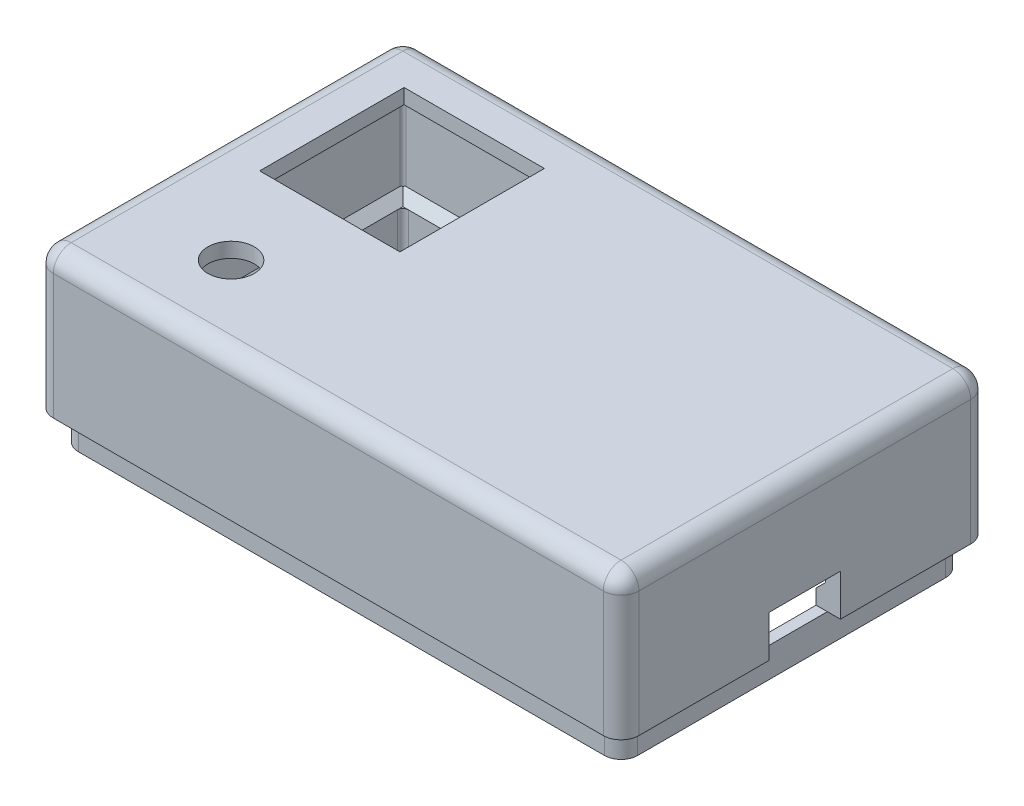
ISO-10303-21;
HEADER;
FILE_DESCRIPTION(('STEP AP214'),'2;1');
FILE_NAME('part.step','',(''),(''),'','','');
FILE_SCHEMA(('AUTOMOTIVE_DESIGN { 1 0 10303 214 1 1 1 1 }'));
ENDSEC;
DATA;
#1=APPLICATION_CONTEXT('core data for automotive mechanical design processes');
#2=APPLICATION_PROTOCOL_DEFINITION('international standard','automotive_design',2000,#1);
#3=PRODUCT_CONTEXT('',#1,'mechanical');
#4=PRODUCT('Part','Part','',(#3));
#5=PRODUCT_RELATED_PRODUCT_CATEGORY('part','',(#4));
#6=PRODUCT_DEFINITION_FORMATION('','',#4);
#7=PRODUCT_DEFINITION_CONTEXT('part definition',#1,'design');
#8=PRODUCT_DEFINITION('design','',#6,#7);
#9=PRODUCT_DEFINITION_SHAPE('','',#8);
#10=(LENGTH_UNIT() NAMED_UNIT(*) SI_UNIT(.MILLI.,.METRE.));
#11=(NAMED_UNIT(*) PLANE_ANGLE_UNIT() SI_UNIT($,.RADIAN.));
#12=(NAMED_UNIT(*) SI_UNIT($,.STERADIAN.) SOLID_ANGLE_UNIT());
#13=UNCERTAINTY_MEASURE_WITH_UNIT(LENGTH_MEASURE(1.E-05),#10,'distance_accuracy_value','');
#14=(GEOMETRIC_REPRESENTATION_CONTEXT(3) GLOBAL_UNCERTAINTY_ASSIGNED_CONTEXT((#13)) GLOBAL_UNIT_ASSIGNED_CONTEXT((#10,
#11,#12)) REPRESENTATION_CONTEXT('',''));
#15=CARTESIAN_POINT('',(0.,0.,0.));
#16=DIRECTION('',(0.,0.,1.));
#17=DIRECTION('',(1.,0.,0.));
#18=AXIS2_PLACEMENT_3D('',#15,#16,#17);
#19=CARTESIAN_POINT('',(46.75,32.1,27.85));
#20=DIRECTION('',(0.707106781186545,-0.70710678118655,0.));
#21=DIRECTION('',(0.,0.,1.));
#22=AXIS2_PLACEMENT_3D('',#19,#20,#21);
#23=PLANE('',#22);
#24=DIRECTION('',(0.,0.,1.));
#25=VECTOR('',#24,1.);
#26=CARTESIAN_POINT('',(46.75,32.1,27.85));
#27=LINE('',#26,#25);
#28=CARTESIAN_POINT('',(46.75,32.1,5.94999999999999));
#29=VERTEX_POINT('',#28);
#30=CARTESIAN_POINT('',(46.75,32.1,27.85));
#31=VERTEX_POINT('',#30);
#32=EDGE_CURVE('E719',#29,#31,#27,.T.);
#33=ORIENTED_EDGE('',*,*,#32,.F.);
#34=DIRECTION('',(-0.70710678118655,-0.707106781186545,0.));
#35=VECTOR('',#34,1.);
#36=CARTESIAN_POINT('',(46.75,32.1,5.94999999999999));
#37=LINE('',#36,#35);
#38=CARTESIAN_POINT('',(45.15,30.5,5.94999999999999));
#39=VERTEX_POINT('',#38);
#40=EDGE_CURVE('E763',#29,#39,#37,.T.);
#41=ORIENTED_EDGE('',*,*,#40,.T.);
#42=DIRECTION('',(0.,0.,-1.));
#43=VECTOR('',#42,1.);
#44=CARTESIAN_POINT('',(45.15,30.5,0.));
#45=LINE('',#44,#43);
#46=CARTESIAN_POINT('',(45.15,30.5,25.85));
#47=VERTEX_POINT('',#46);
#48=EDGE_CURVE('E846',#47,#39,#45,.T.);
#49=ORIENTED_EDGE('',*,*,#48,.F.);
#50=DIRECTION('',(0.,0.,-1.));
#51=VECTOR('',#50,1.);
#52=CARTESIAN_POINT('',(45.15,30.5,27.85));
#53=LINE('',#52,#51);
#54=CARTESIAN_POINT('',(45.15,30.5,26.75));
#55=VERTEX_POINT('',#54);
#56=EDGE_CURVE('E732',#55,#47,#53,.T.);
#57=ORIENTED_EDGE('',*,*,#56,.F.);
#58=DIRECTION('',(-0.577350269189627,-0.577350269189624,-0.577350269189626));
#59=VECTOR('',#58,1.);
#60=CARTESIAN_POINT('',(46.5833333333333,31.9333333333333,28.1833333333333));
#61=LINE('',#60,#59);
#62=CARTESIAN_POINT('',(46.6035533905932,31.9535533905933,28.2035533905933));
#63=VERTEX_POINT('',#62);
#64=EDGE_CURVE('E726',#63,#55,#61,.T.);
#65=ORIENTED_EDGE('',*,*,#64,.F.);
#66=CARTESIAN_POINT('',(46.25,31.6,27.85));
#67=DIRECTION('',(0.707106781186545,-0.70710678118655,0.));
#68=DIRECTION('',(0.70710678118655,0.707106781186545,0.));
#69=AXIS2_PLACEMENT_3D('',#66,#67,#68);
#70=ELLIPSE('',#69,0.707106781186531,0.49999999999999);
#71=EDGE_CURVE('E723',#31,#63,#70,.T.);
#72=ORIENTED_EDGE('',*,*,#71,.F.);
#73=EDGE_LOOP('',(#33,#41,#49,#57,#65,#72));
#74=FACE_BOUND('',#73,.T.);
#75=ADVANCED_FACE('F144',(#74),#23,.F.);
#76=CARTESIAN_POINT('',(45.15,30.5,-6.05000000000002));
#77=VERTEX_POINT('',#76);
#78=CARTESIAN_POINT('',(45.15,30.5,-25.95));
#79=VERTEX_POINT('',#78);
#80=EDGE_CURVE('E832',#77,#79,#45,.T.);
#81=ORIENTED_EDGE('',*,*,#80,.F.);
#82=DIRECTION('',(0.70710678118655,0.707106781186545,0.));
#83=VECTOR('',#82,1.);
#84=CARTESIAN_POINT('',(46.75,32.1,-6.05000000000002));
#85=LINE('',#84,#83);
#86=CARTESIAN_POINT('',(46.75,32.1,-6.05000000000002));
#87=VERTEX_POINT('',#86);
#88=EDGE_CURVE('E758',#77,#87,#85,.T.);
#89=ORIENTED_EDGE('',*,*,#88,.T.);
#90=CARTESIAN_POINT('',(46.75,32.1,-27.95));
#91=VERTEX_POINT('',#90);
#92=EDGE_CURVE('E720',#91,#87,#27,.T.);
#93=ORIENTED_EDGE('',*,*,#92,.F.);
#94=CARTESIAN_POINT('',(46.25,31.6,-27.95));
#95=DIRECTION('',(0.707106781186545,-0.70710678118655,0.));
#96=DIRECTION('',(0.70710678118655,0.707106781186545,0.));
#97=AXIS2_PLACEMENT_3D('',#94,#95,#96);
#98=ELLIPSE('',#97,0.707106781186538,0.499999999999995);
#99=CARTESIAN_POINT('',(46.6035533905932,31.9535533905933,-28.3035533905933));
#100=VERTEX_POINT('',#99);
#101=EDGE_CURVE('E737',#100,#91,#98,.T.);
#102=ORIENTED_EDGE('',*,*,#101,.F.);
#103=DIRECTION('',(0.577350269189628,0.577350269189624,-0.577350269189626));
#104=VECTOR('',#103,1.);
#105=CARTESIAN_POINT('',(27.9833333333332,13.3333333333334,-9.68333333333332));
#106=LINE('',#105,#104);
#107=CARTESIAN_POINT('',(45.15,30.5,-26.85));
#108=VERTEX_POINT('',#107);
#109=EDGE_CURVE('E734',#108,#100,#106,.T.);
#110=ORIENTED_EDGE('',*,*,#109,.F.);
#111=DIRECTION('',(0.,0.,-1.));
#112=VECTOR('',#111,1.);
#113=CARTESIAN_POINT('',(45.15,30.5,27.85));
#114=LINE('',#113,#112);
#115=EDGE_CURVE('E729',#79,#108,#114,.T.);
#116=ORIENTED_EDGE('',*,*,#115,.F.);
#117=EDGE_LOOP('',(#81,#89,#93,#102,#110,#116));
#118=FACE_BOUND('',#117,.T.);
#119=ADVANCED_FACE('F147',(#118),#23,.F.);
#120=CARTESIAN_POINT('',(-46.25,30.5,27.85));
#121=DIRECTION('',(0.,1.,0.));
#122=DIRECTION('',(0.,0.,1.));
#123=AXIS2_PLACEMENT_3D('',#120,#121,#122);
#124=PLANE('',#123);
#125=DIRECTION('',(1.,0.,0.));
#126=VECTOR('',#125,1.);
#127=CARTESIAN_POINT('',(-46.25,30.5,26.75));
#128=LINE('',#127,#126);
#129=CARTESIAN_POINT('',(44.25,30.5,26.75));
#130=VERTEX_POINT('',#129);
#131=EDGE_CURVE('E712',#130,#55,#128,.T.);
#132=ORIENTED_EDGE('',*,*,#131,.T.);
#133=ORIENTED_EDGE('',*,*,#56,.T.);
#134=CARTESIAN_POINT('',(44.25,30.5,25.85));
#135=DIRECTION('',(0.,1.,0.));
#136=DIRECTION('',(0.,0.,1.));
#137=AXIS2_PLACEMENT_3D('',#134,#135,#136);
#138=CIRCLE('',#137,0.899999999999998);
#139=EDGE_CURVE('E849',#130,#47,#138,.T.);
#140=ORIENTED_EDGE('',*,*,#139,.F.);
#141=EDGE_LOOP('',(#132,#133,#140));
#142=FACE_BOUND('',#141,.T.);
#143=ADVANCED_FACE('F979',(#142),#124,.T.);
#144=CARTESIAN_POINT('',(-46.25,32.1,28.35));
#145=DIRECTION('',(0.,-0.707106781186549,0.707106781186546));
#146=DIRECTION('',(-1.,0.,0.));
#147=AXIS2_PLACEMENT_3D('',#144,#145,#146);
#148=PLANE('',#147);
#149=CARTESIAN_POINT('',(46.25,31.6,27.85));
#150=DIRECTION('',(0.,-0.707106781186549,0.707106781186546));
#151=DIRECTION('',(0.,0.707106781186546,0.707106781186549));
#152=AXIS2_PLACEMENT_3D('',#149,#150,#151);
#153=ELLIPSE('',#152,0.707106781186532,0.49999999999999);
#154=CARTESIAN_POINT('',(46.25,32.1,28.35));
#155=VERTEX_POINT('',#154);
#156=EDGE_CURVE('E717',#63,#155,#153,.T.);
#157=ORIENTED_EDGE('',*,*,#156,.F.);
#158=ORIENTED_EDGE('',*,*,#64,.T.);
#159=ORIENTED_EDGE('',*,*,#131,.F.);
#160=DIRECTION('',(1.,0.,0.));
#161=VECTOR('',#160,1.);
#162=CARTESIAN_POINT('',(0.,30.5,26.75));
#163=LINE('',#162,#161);
#164=CARTESIAN_POINT('',(-44.25,30.5,26.75));
#165=VERTEX_POINT('',#164);
#166=EDGE_CURVE('E852',#165,#130,#163,.T.);
#167=ORIENTED_EDGE('',*,*,#166,.F.);
#168=DIRECTION('',(1.,0.,0.));
#169=VECTOR('',#168,1.);
#170=CARTESIAN_POINT('',(-46.25,30.5,26.75));
#171=LINE('',#170,#169);
#172=CARTESIAN_POINT('',(-45.15,30.5,26.75));
#173=VERTEX_POINT('',#172);
#174=EDGE_CURVE('E715',#173,#165,#171,.T.);
#175=ORIENTED_EDGE('',*,*,#174,.F.);
#176=DIRECTION('',(0.577350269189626,-0.577350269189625,-0.577350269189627));
#177=VECTOR('',#176,1.);
#178=CARTESIAN_POINT('',(-46.5833333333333,31.9333333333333,28.1833333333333));
#179=LINE('',#178,#177);
#180=CARTESIAN_POINT('',(-46.6035533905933,31.9535533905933,28.2035533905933));
#181=VERTEX_POINT('',#180);
#182=EDGE_CURVE('E709',#181,#173,#179,.T.);
#183=ORIENTED_EDGE('',*,*,#182,.F.);
#184=CARTESIAN_POINT('',(-46.25,31.6,27.85));
#185=DIRECTION('',(0.,-0.707106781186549,0.707106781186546));
#186=DIRECTION('',(0.,0.707106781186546,0.707106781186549));
#187=AXIS2_PLACEMENT_3D('',#184,#185,#186);
#188=ELLIPSE('',#187,0.707106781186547,0.5);
#189=CARTESIAN_POINT('',(-46.25,32.1,28.35));
#190=VERTEX_POINT('',#189);
#191=EDGE_CURVE('E706',#190,#181,#188,.T.);
#192=ORIENTED_EDGE('',*,*,#191,.F.);
#193=DIRECTION('',(-1.,0.,0.));
#194=VECTOR('',#193,1.);
#195=CARTESIAN_POINT('',(-46.25,32.1,28.35));
#196=LINE('',#195,#194);
#197=EDGE_CURVE('E703',#155,#190,#196,.T.);
#198=ORIENTED_EDGE('',*,*,#197,.F.);
#199=EDGE_LOOP('',(#157,#158,#159,#167,#175,#183,#192,#198));
#200=FACE_BOUND('',#199,.T.);
#201=ADVANCED_FACE('F1040',(#200),#148,.F.);
#202=DIRECTION('',(0.,0.,1.));
#203=VECTOR('',#202,1.);
#204=CARTESIAN_POINT('',(-45.15,30.5,27.85));
#205=LINE('',#204,#203);
#206=CARTESIAN_POINT('',(-45.15,30.5,25.85));
#207=VERTEX_POINT('',#206);
#208=EDGE_CURVE('E680',#207,#173,#205,.T.);
#209=ORIENTED_EDGE('',*,*,#208,.T.);
#210=ORIENTED_EDGE('',*,*,#174,.T.);
#211=CARTESIAN_POINT('',(-44.25,30.5,25.85));
#212=DIRECTION('',(0.,1.,0.));
#213=DIRECTION('',(0.,0.,1.));
#214=AXIS2_PLACEMENT_3D('',#211,#212,#213);
#215=CIRCLE('',#214,0.9);
#216=EDGE_CURVE('E855',#207,#165,#215,.T.);
#217=ORIENTED_EDGE('',*,*,#216,.F.);
#218=EDGE_LOOP('',(#209,#210,#217));
#219=FACE_BOUND('',#218,.T.);
#220=ADVANCED_FACE('F1047',(#219),#124,.T.);
#221=CARTESIAN_POINT('',(46.25,32.1,-28.45));
#222=DIRECTION('',(0.,-0.707106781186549,-0.707106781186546));
#223=DIRECTION('',(1.,0.,0.));
#224=AXIS2_PLACEMENT_3D('',#221,#222,#223);
#225=PLANE('',#224);
#226=DIRECTION('',(-1.,0.,0.));
#227=VECTOR('',#226,1.);
#228=CARTESIAN_POINT('',(-46.25,30.5,-26.85));
#229=LINE('',#228,#227);
#230=CARTESIAN_POINT('',(44.25,30.5,-26.85));
#231=VERTEX_POINT('',#230);
#232=EDGE_CURVE('E696',#108,#231,#229,.T.);
#233=ORIENTED_EDGE('',*,*,#232,.F.);
#234=ORIENTED_EDGE('',*,*,#109,.T.);
#235=CARTESIAN_POINT('',(46.25,31.6,-27.95));
#236=DIRECTION('',(0.,-0.707106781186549,-0.707106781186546));
#237=DIRECTION('',(0.,0.707106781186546,-0.707106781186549));
#238=AXIS2_PLACEMENT_3D('',#235,#236,#237);
#239=ELLIPSE('',#238,0.707106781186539,0.499999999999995);
#240=CARTESIAN_POINT('',(46.25,32.1,-28.45));
#241=VERTEX_POINT('',#240);
#242=EDGE_CURVE('E690',#241,#100,#239,.T.);
#243=ORIENTED_EDGE('',*,*,#242,.F.);
#244=DIRECTION('',(1.,0.,0.));
#245=VECTOR('',#244,1.);
#246=CARTESIAN_POINT('',(46.25,32.1,-28.45));
#247=LINE('',#246,#245);
#248=CARTESIAN_POINT('',(-46.25,32.1,-28.45));
#249=VERTEX_POINT('',#248);
#250=EDGE_CURVE('E687',#249,#241,#247,.T.);
#251=ORIENTED_EDGE('',*,*,#250,.F.);
#252=CARTESIAN_POINT('',(-46.25,31.6,-27.95));
#253=DIRECTION('',(0.,-0.707106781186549,-0.707106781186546));
#254=DIRECTION('',(0.,0.707106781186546,-0.707106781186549));
#255=AXIS2_PLACEMENT_3D('',#252,#253,#254);
#256=ELLIPSE('',#255,0.707106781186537,0.499999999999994);
#257=CARTESIAN_POINT('',(-46.6035533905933,31.9535533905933,-28.3035533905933));
#258=VERTEX_POINT('',#257);
#259=EDGE_CURVE('E701',#258,#249,#256,.T.);
#260=ORIENTED_EDGE('',*,*,#259,.F.);
#261=DIRECTION('',(-0.577350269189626,0.577350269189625,-0.577350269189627));
#262=VECTOR('',#261,1.);
#263=CARTESIAN_POINT('',(-15.75,1.10000000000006,2.55000000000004));
#264=LINE('',#263,#262);
#265=CARTESIAN_POINT('',(-45.15,30.5,-26.85));
#266=VERTEX_POINT('',#265);
#267=EDGE_CURVE('E698',#266,#258,#264,.T.);
#268=ORIENTED_EDGE('',*,*,#267,.F.);
#269=DIRECTION('',(-1.,0.,0.));
#270=VECTOR('',#269,1.);
#271=CARTESIAN_POINT('',(-46.25,30.5,-26.85));
#272=LINE('',#271,#270);
#273=CARTESIAN_POINT('',(-44.25,30.5,-26.85));
#274=VERTEX_POINT('',#273);
#275=EDGE_CURVE('E693',#274,#266,#272,.T.);
#276=ORIENTED_EDGE('',*,*,#275,.F.);
#277=DIRECTION('',(-1.,0.,0.));
#278=VECTOR('',#277,1.);
#279=CARTESIAN_POINT('',(0.,30.5,-26.85));
#280=LINE('',#279,#278);
#281=EDGE_CURVE('E514',#231,#274,#280,.T.);
#282=ORIENTED_EDGE('',*,*,#281,.F.);
#283=EDGE_LOOP('',(#233,#234,#243,#251,#260,#268,#276,#282));
#284=FACE_BOUND('',#283,.T.);
#285=ADVANCED_FACE('F1070',(#284),#225,.F.);
#286=CARTESIAN_POINT('',(44.25,30.5,-25.95));
#287=DIRECTION('',(0.,1.,0.));
#288=DIRECTION('',(0.,0.,1.));
#289=AXIS2_PLACEMENT_3D('',#286,#287,#288);
#290=CIRCLE('',#289,0.900000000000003);
#291=EDGE_CURVE('E621',#79,#231,#290,.T.);
#292=ORIENTED_EDGE('',*,*,#291,.F.);
#293=ORIENTED_EDGE('',*,*,#115,.T.);
#294=ORIENTED_EDGE('',*,*,#232,.T.);
#295=EDGE_LOOP('',(#292,#293,#294));
#296=FACE_BOUND('',#295,.T.);
#297=ADVANCED_FACE('F1077',(#296),#124,.T.);
#298=CARTESIAN_POINT('',(-46.75,32.1,-27.95));
#299=DIRECTION('',(-0.707106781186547,-0.707106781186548,0.));
#300=DIRECTION('',(0.,0.,-1.));
#301=AXIS2_PLACEMENT_3D('',#298,#299,#300);
#302=PLANE('',#301);
#303=CARTESIAN_POINT('',(-46.25,31.6,27.85));
#304=DIRECTION('',(-0.707106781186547,-0.707106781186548,0.));
#305=DIRECTION('',(-0.707106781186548,0.707106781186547,0.));
#306=AXIS2_PLACEMENT_3D('',#303,#304,#305);
#307=ELLIPSE('',#306,0.707106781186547,0.5);
#308=CARTESIAN_POINT('',(-46.75,32.1,27.85));
#309=VERTEX_POINT('',#308);
#310=EDGE_CURVE('E685',#181,#309,#307,.T.);
#311=ORIENTED_EDGE('',*,*,#310,.F.);
#312=ORIENTED_EDGE('',*,*,#182,.T.);
#313=ORIENTED_EDGE('',*,*,#208,.F.);
#314=DIRECTION('',(0.,0.,1.));
#315=VECTOR('',#314,1.);
#316=CARTESIAN_POINT('',(-45.15,30.5,0.));
#317=LINE('',#316,#315);
#318=CARTESIAN_POINT('',(-45.15,30.5,-25.95));
#319=VERTEX_POINT('',#318);
#320=EDGE_CURVE('E858',#319,#207,#317,.T.);
#321=ORIENTED_EDGE('',*,*,#320,.F.);
#322=DIRECTION('',(0.,0.,1.));
#323=VECTOR('',#322,1.);
#324=CARTESIAN_POINT('',(-45.15,30.5,27.85));
#325=LINE('',#324,#323);
#326=EDGE_CURVE('E683',#266,#319,#325,.T.);
#327=ORIENTED_EDGE('',*,*,#326,.F.);
#328=ORIENTED_EDGE('',*,*,#267,.T.);
#329=CARTESIAN_POINT('',(-46.25,31.6,-27.95));
#330=DIRECTION('',(-0.707106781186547,-0.707106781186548,0.));
#331=DIRECTION('',(-0.707106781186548,0.707106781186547,0.));
#332=AXIS2_PLACEMENT_3D('',#329,#330,#331);
#333=ELLIPSE('',#332,0.707106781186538,0.499999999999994);
#334=CARTESIAN_POINT('',(-46.75,32.1,-27.95));
#335=VERTEX_POINT('',#334);
#336=EDGE_CURVE('E677',#335,#258,#333,.T.);
#337=ORIENTED_EDGE('',*,*,#336,.F.);
#338=DIRECTION('',(0.,0.,-1.));
#339=VECTOR('',#338,1.);
#340=CARTESIAN_POINT('',(-46.75,32.1,-27.95));
#341=LINE('',#340,#339);
#342=EDGE_CURVE('E650',#309,#335,#341,.T.);
#343=ORIENTED_EDGE('',*,*,#342,.F.);
#344=EDGE_LOOP('',(#311,#312,#313,#321,#327,#328,#337,#343));
#345=FACE_BOUND('',#344,.T.);
#346=ADVANCED_FACE('F1055',(#345),#302,.F.);
#347=CARTESIAN_POINT('',(0.,28.,-26.85));
#348=DIRECTION('',(0.,0.,1.));
#349=DIRECTION('',(1.,0.,0.));
#350=AXIS2_PLACEMENT_3D('',#347,#348,#349);
#351=PLANE('',#350);
#352=DIRECTION('',(0.,-1.,0.));
#353=VECTOR('',#352,1.);
#354=CARTESIAN_POINT('',(44.25,28.,-26.85));
#355=LINE('',#354,#353);
#356=CARTESIAN_POINT('',(44.25,23.,-26.85));
#357=VERTEX_POINT('',#356);
#358=EDGE_CURVE('E539',#231,#357,#355,.T.);
#359=ORIENTED_EDGE('',*,*,#358,.F.);
#360=ORIENTED_EDGE('',*,*,#281,.T.);
#361=DIRECTION('',(0.,-1.,0.));
#362=VECTOR('',#361,1.);
#363=CARTESIAN_POINT('',(-44.25,28.,-26.85));
#364=LINE('',#363,#362);
#365=CARTESIAN_POINT('',(-44.25,23.,-26.85));
#366=VERTEX_POINT('',#365);
#367=EDGE_CURVE('E553',#274,#366,#364,.T.);
#368=ORIENTED_EDGE('',*,*,#367,.T.);
#369=DIRECTION('',(-1.,0.,0.));
#370=VECTOR('',#369,1.);
#371=CARTESIAN_POINT('',(0.,23.,-26.85));
#372=LINE('',#371,#370);
#373=EDGE_CURVE('E515',#357,#366,#372,.T.);
#374=ORIENTED_EDGE('',*,*,#373,.F.);
#375=EDGE_LOOP('',(#359,#360,#368,#374));
#376=FACE_BOUND('',#375,.T.);
#377=ADVANCED_FACE('F1066',(#376),#351,.T.);
#378=CARTESIAN_POINT('',(-44.25,28.,-25.95));
#379=DIRECTION('',(0.,-1.,0.));
#380=DIRECTION('',(0.,0.,-1.));
#381=AXIS2_PLACEMENT_3D('',#378,#379,#380);
#382=CYLINDRICAL_SURFACE('',#381,0.899999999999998);
#383=ORIENTED_EDGE('',*,*,#367,.F.);
#384=CARTESIAN_POINT('',(-44.25,30.5,-25.95));
#385=DIRECTION('',(0.,1.,0.));
#386=DIRECTION('',(0.,0.,1.));
#387=AXIS2_PLACEMENT_3D('',#384,#385,#386);
#388=CIRCLE('',#387,0.899999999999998);
#389=EDGE_CURVE('E861',#274,#319,#388,.T.);
#390=ORIENTED_EDGE('',*,*,#389,.T.);
#391=DIRECTION('',(0.,-1.,0.));
#392=VECTOR('',#391,1.);
#393=CARTESIAN_POINT('',(-45.15,28.,-25.95));
#394=LINE('',#393,#392);
#395=CARTESIAN_POINT('',(-45.15,23.,-25.95));
#396=VERTEX_POINT('',#395);
#397=EDGE_CURVE('E551',#319,#396,#394,.T.);
#398=ORIENTED_EDGE('',*,*,#397,.T.);
#399=CARTESIAN_POINT('',(-44.25,23.,-25.95));
#400=DIRECTION('',(0.,1.,0.));
#401=DIRECTION('',(0.,0.,1.));
#402=AXIS2_PLACEMENT_3D('',#399,#400,#401);
#403=CIRCLE('',#402,0.899999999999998);
#404=EDGE_CURVE('E518',#366,#396,#403,.T.);
#405=ORIENTED_EDGE('',*,*,#404,.F.);
#406=EDGE_LOOP('',(#383,#390,#398,#405));
#407=FACE_BOUND('',#406,.T.);
#408=ADVANCED_FACE('F1059',(#407),#382,.F.);
#409=CARTESIAN_POINT('',(-45.15,28.,0.));
#410=DIRECTION('',(1.,0.,0.));
#411=DIRECTION('',(0.,0.,-1.));
#412=AXIS2_PLACEMENT_3D('',#409,#410,#411);
#413=PLANE('',#412);
#414=ORIENTED_EDGE('',*,*,#397,.F.);
#415=ORIENTED_EDGE('',*,*,#320,.T.);
#416=DIRECTION('',(0.,-1.,0.));
#417=VECTOR('',#416,1.);
#418=CARTESIAN_POINT('',(-45.15,28.,25.85));
#419=LINE('',#418,#417);
#420=CARTESIAN_POINT('',(-45.15,23.,25.85));
#421=VERTEX_POINT('',#420);
#422=EDGE_CURVE('E549',#207,#421,#419,.T.);
#423=ORIENTED_EDGE('',*,*,#422,.T.);
#424=DIRECTION('',(0.,0.,1.));
#425=VECTOR('',#424,1.);
#426=CARTESIAN_POINT('',(-45.15,23.,0.));
#427=LINE('',#426,#425);
#428=EDGE_CURVE('E521',#396,#421,#427,.T.);
#429=ORIENTED_EDGE('',*,*,#428,.F.);
#430=EDGE_LOOP('',(#414,#415,#423,#429));
#431=FACE_BOUND('',#430,.T.);
#432=ADVANCED_FACE('F1051',(#431),#413,.T.);
#433=CARTESIAN_POINT('',(-44.25,28.,25.85));
#434=DIRECTION('',(0.,-1.,0.));
#435=DIRECTION('',(0.,0.,-1.));
#436=AXIS2_PLACEMENT_3D('',#433,#434,#435);
#437=CYLINDRICAL_SURFACE('',#436,0.9);
#438=ORIENTED_EDGE('',*,*,#422,.F.);
#439=ORIENTED_EDGE('',*,*,#216,.T.);
#440=DIRECTION('',(0.,-1.,0.));
#441=VECTOR('',#440,1.);
#442=CARTESIAN_POINT('',(-44.25,28.,26.75));
#443=LINE('',#442,#441);
#444=CARTESIAN_POINT('',(-44.25,23.,26.75));
#445=VERTEX_POINT('',#444);
#446=EDGE_CURVE('E547',#165,#445,#443,.T.);
#447=ORIENTED_EDGE('',*,*,#446,.T.);
#448=CARTESIAN_POINT('',(-44.25,23.,25.85));
#449=DIRECTION('',(0.,1.,0.));
#450=DIRECTION('',(0.,0.,1.));
#451=AXIS2_PLACEMENT_3D('',#448,#449,#450);
#452=CIRCLE('',#451,0.9);
#453=EDGE_CURVE('E524',#421,#445,#452,.T.);
#454=ORIENTED_EDGE('',*,*,#453,.F.);
#455=EDGE_LOOP('',(#438,#439,#447,#454));
#456=FACE_BOUND('',#455,.T.);
#457=ADVANCED_FACE('F1044',(#456),#437,.F.);
#458=CARTESIAN_POINT('',(0.,28.,26.75));
#459=DIRECTION('',(0.,0.,-1.));
#460=DIRECTION('',(-1.,0.,0.));
#461=AXIS2_PLACEMENT_3D('',#458,#459,#460);
#462=PLANE('',#461);
#463=ORIENTED_EDGE('',*,*,#446,.F.);
#464=ORIENTED_EDGE('',*,*,#166,.T.);
#465=DIRECTION('',(0.,-1.,0.));
#466=VECTOR('',#465,1.);
#467=CARTESIAN_POINT('',(44.25,28.,26.75));
#468=LINE('',#467,#466);
#469=CARTESIAN_POINT('',(44.25,23.,26.75));
#470=VERTEX_POINT('',#469);
#471=EDGE_CURVE('E545',#130,#470,#468,.T.);
#472=ORIENTED_EDGE('',*,*,#471,.T.);
#473=DIRECTION('',(1.,0.,0.));
#474=VECTOR('',#473,1.);
#475=CARTESIAN_POINT('',(0.,23.,26.75));
#476=LINE('',#475,#474);
#477=EDGE_CURVE('E527',#445,#470,#476,.T.);
#478=ORIENTED_EDGE('',*,*,#477,.F.);
#479=EDGE_LOOP('',(#463,#464,#472,#478));
#480=FACE_BOUND('',#479,.T.);
#481=ADVANCED_FACE('F1037',(#480),#462,.T.);
#482=CARTESIAN_POINT('',(44.25,28.,25.85));
#483=DIRECTION('',(0.,-1.,0.));
#484=DIRECTION('',(0.,0.,-1.));
#485=AXIS2_PLACEMENT_3D('',#482,#483,#484);
#486=CYLINDRICAL_SURFACE('',#485,0.899999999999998);
#487=ORIENTED_EDGE('',*,*,#471,.F.);
#488=ORIENTED_EDGE('',*,*,#139,.T.);
#489=DIRECTION('',(0.,-1.,0.));
#490=VECTOR('',#489,1.);
#491=CARTESIAN_POINT('',(45.15,28.,25.85));
#492=LINE('',#491,#490);
#493=CARTESIAN_POINT('',(45.15,23.,25.85));
#494=VERTEX_POINT('',#493);
#495=EDGE_CURVE('E543',#47,#494,#492,.T.);
#496=ORIENTED_EDGE('',*,*,#495,.T.);
#497=CARTESIAN_POINT('',(44.25,23.,25.85));
#498=DIRECTION('',(0.,1.,0.));
#499=DIRECTION('',(0.,0.,1.));
#500=AXIS2_PLACEMENT_3D('',#497,#498,#499);
#501=CIRCLE('',#500,0.899999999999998);
#502=EDGE_CURVE('E530',#470,#494,#501,.T.);
#503=ORIENTED_EDGE('',*,*,#502,.F.);
#504=EDGE_LOOP('',(#487,#488,#496,#503));
#505=FACE_BOUND('',#504,.T.);
#506=ADVANCED_FACE('F1031',(#505),#486,.F.);
#507=CARTESIAN_POINT('',(45.15,28.,0.));
#508=DIRECTION('',(-1.,0.,0.));
#509=DIRECTION('',(0.,0.,1.));
#510=AXIS2_PLACEMENT_3D('',#507,#508,#509);
#511=PLANE('',#510);
#512=DIRECTION('',(0.,1.,0.));
#513=VECTOR('',#512,1.);
#514=CARTESIAN_POINT('',(45.15,28.,5.94999999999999));
#515=LINE('',#514,#513);
#516=CARTESIAN_POINT('',(45.15,28.,5.94999999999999));
#517=VERTEX_POINT('',#516);
#518=EDGE_CURVE('E766',#517,#39,#515,.T.);
#519=ORIENTED_EDGE('',*,*,#518,.F.);
#520=DIRECTION('',(0.,0.,1.));
#521=VECTOR('',#520,1.);
#522=CARTESIAN_POINT('',(45.15,28.,0.));
#523=LINE('',#522,#521);
#524=CARTESIAN_POINT('',(45.15,28.,-6.05000000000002));
#525=VERTEX_POINT('',#524);
#526=EDGE_CURVE('E655',#525,#517,#523,.T.);
#527=ORIENTED_EDGE('',*,*,#526,.F.);
#528=DIRECTION('',(0.,-1.,0.));
#529=VECTOR('',#528,1.);
#530=CARTESIAN_POINT('',(45.15,28.,-6.05000000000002));
#531=LINE('',#530,#529);
#532=EDGE_CURVE('E761',#77,#525,#531,.T.);
#533=ORIENTED_EDGE('',*,*,#532,.F.);
#534=ORIENTED_EDGE('',*,*,#80,.T.);
#535=DIRECTION('',(0.,-1.,0.));
#536=VECTOR('',#535,1.);
#537=CARTESIAN_POINT('',(45.15,28.,-25.95));
#538=LINE('',#537,#536);
#539=CARTESIAN_POINT('',(45.15,23.,-25.95));
#540=VERTEX_POINT('',#539);
#541=EDGE_CURVE('E541',#79,#540,#538,.T.);
#542=ORIENTED_EDGE('',*,*,#541,.T.);
#543=DIRECTION('',(0.,0.,-1.));
#544=VECTOR('',#543,1.);
#545=CARTESIAN_POINT('',(45.15,23.,0.));
#546=LINE('',#545,#544);
#547=EDGE_CURVE('E533',#494,#540,#546,.T.);
#548=ORIENTED_EDGE('',*,*,#547,.F.);
#549=ORIENTED_EDGE('',*,*,#495,.F.);
#550=ORIENTED_EDGE('',*,*,#48,.T.);
#551=EDGE_LOOP('',(#519,#527,#533,#534,#542,#548,#549,#550));
#552=FACE_BOUND('',#551,.T.);
#553=ADVANCED_FACE('F1025',(#552),#511,.T.);
#554=CARTESIAN_POINT('',(44.25,28.,-25.95));
#555=DIRECTION('',(0.,-1.,0.));
#556=DIRECTION('',(0.,0.,-1.));
#557=AXIS2_PLACEMENT_3D('',#554,#555,#556);
#558=CYLINDRICAL_SURFACE('',#557,0.900000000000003);
#559=ORIENTED_EDGE('',*,*,#541,.F.);
#560=ORIENTED_EDGE('',*,*,#291,.T.);
#561=ORIENTED_EDGE('',*,*,#358,.T.);
#562=CARTESIAN_POINT('',(44.25,23.,-25.95));
#563=DIRECTION('',(0.,1.,0.));
#564=DIRECTION('',(0.,0.,1.));
#565=AXIS2_PLACEMENT_3D('',#562,#563,#564);
#566=CIRCLE('',#565,0.900000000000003);
#567=EDGE_CURVE('E536',#540,#357,#566,.T.);
#568=ORIENTED_EDGE('',*,*,#567,.F.);
#569=EDGE_LOOP('',(#559,#560,#561,#568));
#570=FACE_BOUND('',#569,.T.);
#571=ADVANCED_FACE('F1074',(#570),#558,.F.);
#572=CARTESIAN_POINT('',(-44.25,23.,25.85));
#573=DIRECTION('',(0.,1.,0.));
#574=DIRECTION('',(0.,0.,1.));
#575=AXIS2_PLACEMENT_3D('',#572,#573,#574);
#576=PLANE('',#575);
#577=DIRECTION('',(0.,0.,1.));
#578=VECTOR('',#577,1.);
#579=CARTESIAN_POINT('',(-47.05,23.,-25.95));
#580=LINE('',#579,#578);
#581=CARTESIAN_POINT('',(-47.05,23.,-25.95));
#582=VERTEX_POINT('',#581);
#583=CARTESIAN_POINT('',(-47.05,23.,25.85));
#584=VERTEX_POINT('',#583);
#585=EDGE_CURVE('E555',#582,#584,#580,.T.);
#586=ORIENTED_EDGE('',*,*,#585,.F.);
#587=CARTESIAN_POINT('',(-44.25,23.,-25.95));
#588=DIRECTION('',(0.,1.,0.));
#589=DIRECTION('',(0.,0.,1.));
#590=AXIS2_PLACEMENT_3D('',#587,#588,#589);
#591=CIRCLE('',#590,2.79999999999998);
#592=CARTESIAN_POINT('',(-44.25,23.,-28.75));
#593=VERTEX_POINT('',#592);
#594=EDGE_CURVE('E560',#593,#582,#591,.T.);
#595=ORIENTED_EDGE('',*,*,#594,.F.);
#596=DIRECTION('',(-1.,0.,0.));
#597=VECTOR('',#596,1.);
#598=CARTESIAN_POINT('',(44.25,23.,-28.75));
#599=LINE('',#598,#597);
#600=CARTESIAN_POINT('',(44.25,23.,-28.75));
#601=VERTEX_POINT('',#600);
#602=EDGE_CURVE('E595',#601,#593,#599,.T.);
#603=ORIENTED_EDGE('',*,*,#602,.F.);
#604=CARTESIAN_POINT('',(44.25,23.,-25.95));
#605=DIRECTION('',(0.,1.,0.));
#606=DIRECTION('',(0.,0.,1.));
#607=AXIS2_PLACEMENT_3D('',#604,#605,#606);
#608=CIRCLE('',#607,2.8);
#609=CARTESIAN_POINT('',(47.05,23.,-25.95));
#610=VERTEX_POINT('',#609);
#611=EDGE_CURVE('E593',#610,#601,#608,.T.);
#612=ORIENTED_EDGE('',*,*,#611,.F.);
#613=DIRECTION('',(0.,0.,-1.));
#614=VECTOR('',#613,1.);
#615=CARTESIAN_POINT('',(47.05,23.,25.85));
#616=LINE('',#615,#614);
#617=CARTESIAN_POINT('',(47.05,23.,25.85));
#618=VERTEX_POINT('',#617);
#619=EDGE_CURVE('E591',#618,#610,#616,.T.);
#620=ORIENTED_EDGE('',*,*,#619,.F.);
#621=CARTESIAN_POINT('',(44.25,23.,25.85));
#622=DIRECTION('',(0.,1.,0.));
#623=DIRECTION('',(0.,0.,1.));
#624=AXIS2_PLACEMENT_3D('',#621,#622,#623);
#625=CIRCLE('',#624,2.79999999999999);
#626=CARTESIAN_POINT('',(44.25,23.,28.65));
#627=VERTEX_POINT('',#626);
#628=EDGE_CURVE('E589',#627,#618,#625,.T.);
#629=ORIENTED_EDGE('',*,*,#628,.F.);
#630=DIRECTION('',(1.,0.,0.));
#631=VECTOR('',#630,1.);
#632=CARTESIAN_POINT('',(-44.25,23.,28.65));
#633=LINE('',#632,#631);
#634=CARTESIAN_POINT('',(-44.25,23.,28.65));
#635=VERTEX_POINT('',#634);
#636=EDGE_CURVE('E587',#635,#627,#633,.T.);
#637=ORIENTED_EDGE('',*,*,#636,.F.);
#638=CARTESIAN_POINT('',(-44.25,23.,25.85));
#639=DIRECTION('',(0.,1.,0.));
#640=DIRECTION('',(0.,0.,1.));
#641=AXIS2_PLACEMENT_3D('',#638,#639,#640);
#642=CIRCLE('',#641,2.8);
#643=EDGE_CURVE('E585',#584,#635,#642,.T.);
#644=ORIENTED_EDGE('',*,*,#643,.F.);
#645=EDGE_LOOP('',(#586,#595,#603,#612,#620,#629,#637,#644));
#646=FACE_BOUND('',#645,.T.);
#647=ORIENTED_EDGE('',*,*,#373,.T.);
#648=ORIENTED_EDGE('',*,*,#404,.T.);
#649=ORIENTED_EDGE('',*,*,#428,.T.);
#650=ORIENTED_EDGE('',*,*,#453,.T.);
#651=ORIENTED_EDGE('',*,*,#477,.T.);
#652=ORIENTED_EDGE('',*,*,#502,.T.);
#653=ORIENTED_EDGE('',*,*,#547,.T.);
#654=ORIENTED_EDGE('',*,*,#567,.T.);
#655=EDGE_LOOP('',(#647,#648,#649,#650,#651,#652,#653,#654));
#656=FACE_BOUND('',#655,.T.);
#657=ADVANCED_FACE('F944',(#646,#656),#576,.F.);
#658=CARTESIAN_POINT('',(-47.05,28.,-25.95));
#659=DIRECTION('',(1.,0.,0.));
#660=DIRECTION('',(0.,0.,-1.));
#661=AXIS2_PLACEMENT_3D('',#658,#659,#660);
#662=PLANE('',#661);
#663=ORIENTED_EDGE('',*,*,#585,.T.);
#664=DIRECTION('',(0.,-1.,0.));
#665=VECTOR('',#664,1.);
#666=CARTESIAN_POINT('',(-47.05,28.,25.85));
#667=LINE('',#666,#665);
#668=CARTESIAN_POINT('',(-47.05,28.,25.85));
#669=VERTEX_POINT('',#668);
#670=EDGE_CURVE('E618',#669,#584,#667,.T.);
#671=ORIENTED_EDGE('',*,*,#670,.F.);
#672=DIRECTION('',(0.,0.,1.));
#673=VECTOR('',#672,1.);
#674=CARTESIAN_POINT('',(-47.05,28.,-25.95));
#675=LINE('',#674,#673);
#676=CARTESIAN_POINT('',(-47.05,28.,-25.95));
#677=VERTEX_POINT('',#676);
#678=EDGE_CURVE('E556',#677,#669,#675,.T.);
#679=ORIENTED_EDGE('',*,*,#678,.F.);
#680=DIRECTION('',(0.,-1.,0.));
#681=VECTOR('',#680,1.);
#682=CARTESIAN_POINT('',(-47.05,28.,-25.95));
#683=LINE('',#682,#681);
#684=EDGE_CURVE('E582',#677,#582,#683,.T.);
#685=ORIENTED_EDGE('',*,*,#684,.T.);
#686=EDGE_LOOP('',(#663,#671,#679,#685));
#687=FACE_BOUND('',#686,.T.);
#688=ADVANCED_FACE('F960',(#687),#662,.F.);
#689=CARTESIAN_POINT('',(-44.25,28.,25.85));
#690=DIRECTION('',(0.,-1.,0.));
#691=DIRECTION('',(0.,0.,-1.));
#692=AXIS2_PLACEMENT_3D('',#689,#690,#691);
#693=CYLINDRICAL_SURFACE('',#692,2.8);
#694=ORIENTED_EDGE('',*,*,#643,.T.);
#695=DIRECTION('',(0.,-1.,0.));
#696=VECTOR('',#695,1.);
#697=CARTESIAN_POINT('',(-44.25,28.,28.65));
#698=LINE('',#697,#696);
#699=CARTESIAN_POINT('',(-44.25,28.,28.65));
#700=VERTEX_POINT('',#699);
#701=EDGE_CURVE('E615',#700,#635,#698,.T.);
#702=ORIENTED_EDGE('',*,*,#701,.F.);
#703=CARTESIAN_POINT('',(-44.25,28.,25.85));
#704=DIRECTION('',(0.,1.,0.));
#705=DIRECTION('',(0.,0.,1.));
#706=AXIS2_PLACEMENT_3D('',#703,#704,#705);
#707=CIRCLE('',#706,2.8);
#708=EDGE_CURVE('E559',#669,#700,#707,.T.);
#709=ORIENTED_EDGE('',*,*,#708,.F.);
#710=ORIENTED_EDGE('',*,*,#670,.T.);
#711=EDGE_LOOP('',(#694,#702,#709,#710));
#712=FACE_BOUND('',#711,.T.);
#713=ADVANCED_FACE('F963',(#712),#693,.T.);
#714=CARTESIAN_POINT('',(-44.25,28.,28.65));
#715=DIRECTION('',(0.,0.,-1.));
#716=DIRECTION('',(-1.,0.,0.));
#717=AXIS2_PLACEMENT_3D('',#714,#715,#716);
#718=PLANE('',#717);
#719=ORIENTED_EDGE('',*,*,#636,.T.);
#720=DIRECTION('',(0.,-1.,0.));
#721=VECTOR('',#720,1.);
#722=CARTESIAN_POINT('',(44.25,28.,28.65));
#723=LINE('',#722,#721);
#724=CARTESIAN_POINT('',(44.25,28.,28.65));
#725=VERTEX_POINT('',#724);
#726=EDGE_CURVE('E612',#725,#627,#723,.T.);
#727=ORIENTED_EDGE('',*,*,#726,.F.);
#728=DIRECTION('',(1.,0.,0.));
#729=VECTOR('',#728,1.);
#730=CARTESIAN_POINT('',(-44.25,28.,28.65));
#731=LINE('',#730,#729);
#732=EDGE_CURVE('E563',#700,#725,#731,.T.);
#733=ORIENTED_EDGE('',*,*,#732,.F.);
#734=ORIENTED_EDGE('',*,*,#701,.T.);
#735=EDGE_LOOP('',(#719,#727,#733,#734));
#736=FACE_BOUND('',#735,.T.);
#737=ADVANCED_FACE('F965',(#736),#718,.F.);
#738=CARTESIAN_POINT('',(44.25,28.,25.85));
#739=DIRECTION('',(0.,-1.,0.));
#740=DIRECTION('',(0.,0.,-1.));
#741=AXIS2_PLACEMENT_3D('',#738,#739,#740);
#742=CYLINDRICAL_SURFACE('',#741,2.79999999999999);
#743=ORIENTED_EDGE('',*,*,#628,.T.);
#744=DIRECTION('',(0.,-1.,0.));
#745=VECTOR('',#744,1.);
#746=CARTESIAN_POINT('',(47.05,28.,25.85));
#747=LINE('',#746,#745);
#748=CARTESIAN_POINT('',(47.05,28.,25.85));
#749=VERTEX_POINT('',#748);
#750=EDGE_CURVE('E609',#749,#618,#747,.T.);
#751=ORIENTED_EDGE('',*,*,#750,.F.);
#752=CARTESIAN_POINT('',(44.25,28.,25.85));
#753=DIRECTION('',(0.,1.,0.));
#754=DIRECTION('',(0.,0.,1.));
#755=AXIS2_PLACEMENT_3D('',#752,#753,#754);
#756=CIRCLE('',#755,2.79999999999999);
#757=EDGE_CURVE('E566',#725,#749,#756,.T.);
#758=ORIENTED_EDGE('',*,*,#757,.F.);
#759=ORIENTED_EDGE('',*,*,#726,.T.);
#760=EDGE_LOOP('',(#743,#751,#758,#759));
#761=FACE_BOUND('',#760,.T.);
#762=ADVANCED_FACE('F938',(#761),#742,.T.);
#763=CARTESIAN_POINT('',(47.05,28.,25.85));
#764=DIRECTION('',(-1.,0.,0.));
#765=DIRECTION('',(0.,0.,1.));
#766=AXIS2_PLACEMENT_3D('',#763,#764,#765);
#767=PLANE('',#766);
#768=ORIENTED_EDGE('',*,*,#619,.T.);
#769=DIRECTION('',(0.,-1.,0.));
#770=VECTOR('',#769,1.);
#771=CARTESIAN_POINT('',(47.05,28.,-25.95));
#772=LINE('',#771,#770);
#773=CARTESIAN_POINT('',(47.05,28.,-25.95));
#774=VERTEX_POINT('',#773);
#775=EDGE_CURVE('E606',#774,#610,#772,.T.);
#776=ORIENTED_EDGE('',*,*,#775,.F.);
#777=DIRECTION('',(0.,0.,-1.));
#778=VECTOR('',#777,1.);
#779=CARTESIAN_POINT('',(47.05,28.,25.85));
#780=LINE('',#779,#778);
#781=CARTESIAN_POINT('',(47.05,28.,-6.05));
#782=VERTEX_POINT('',#781);
#783=EDGE_CURVE('E569',#782,#774,#780,.T.);
#784=ORIENTED_EDGE('',*,*,#783,.F.);
#785=CARTESIAN_POINT('',(47.05,28.,5.94999999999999));
#786=VERTEX_POINT('',#785);
#787=EDGE_CURVE('E573',#786,#782,#780,.T.);
#788=ORIENTED_EDGE('',*,*,#787,.F.);
#789=EDGE_CURVE('E570',#749,#786,#780,.T.);
#790=ORIENTED_EDGE('',*,*,#789,.F.);
#791=ORIENTED_EDGE('',*,*,#750,.T.);
#792=EDGE_LOOP('',(#768,#776,#784,#788,#790,#791));
#793=FACE_BOUND('',#792,.T.);
#794=ADVANCED_FACE('F933',(#793),#767,.F.);
#795=CARTESIAN_POINT('',(44.25,28.,-25.95));
#796=DIRECTION('',(0.,-1.,0.));
#797=DIRECTION('',(0.,0.,-1.));
#798=AXIS2_PLACEMENT_3D('',#795,#796,#797);
#799=CYLINDRICAL_SURFACE('',#798,2.8);
#800=ORIENTED_EDGE('',*,*,#611,.T.);
#801=DIRECTION('',(0.,-1.,0.));
#802=VECTOR('',#801,1.);
#803=CARTESIAN_POINT('',(44.25,28.,-28.75));
#804=LINE('',#803,#802);
#805=CARTESIAN_POINT('',(44.25,28.,-28.75));
#806=VERTEX_POINT('',#805);
#807=EDGE_CURVE('E603',#806,#601,#804,.T.);
#808=ORIENTED_EDGE('',*,*,#807,.F.);
#809=CARTESIAN_POINT('',(44.25,28.,-25.95));
#810=DIRECTION('',(0.,1.,0.));
#811=DIRECTION('',(0.,0.,1.));
#812=AXIS2_PLACEMENT_3D('',#809,#810,#811);
#813=CIRCLE('',#812,2.8);
#814=EDGE_CURVE('E572',#774,#806,#813,.T.);
#815=ORIENTED_EDGE('',*,*,#814,.F.);
#816=ORIENTED_EDGE('',*,*,#775,.T.);
#817=EDGE_LOOP('',(#800,#808,#815,#816));
#818=FACE_BOUND('',#817,.T.);
#819=ADVANCED_FACE('F950',(#818),#799,.T.);
#820=CARTESIAN_POINT('',(44.25,28.,-28.75));
#821=DIRECTION('',(0.,0.,1.));
#822=DIRECTION('',(1.,0.,0.));
#823=AXIS2_PLACEMENT_3D('',#820,#821,#822);
#824=PLANE('',#823);
#825=ORIENTED_EDGE('',*,*,#602,.T.);
#826=DIRECTION('',(0.,-1.,0.));
#827=VECTOR('',#826,1.);
#828=CARTESIAN_POINT('',(-44.25,28.,-28.75));
#829=LINE('',#828,#827);
#830=CARTESIAN_POINT('',(-44.25,28.,-28.75));
#831=VERTEX_POINT('',#830);
#832=EDGE_CURVE('E600',#831,#593,#829,.T.);
#833=ORIENTED_EDGE('',*,*,#832,.F.);
#834=DIRECTION('',(-1.,0.,0.));
#835=VECTOR('',#834,1.);
#836=CARTESIAN_POINT('',(44.25,28.,-28.75));
#837=LINE('',#836,#835);
#838=EDGE_CURVE('E576',#806,#831,#837,.T.);
#839=ORIENTED_EDGE('',*,*,#838,.F.);
#840=ORIENTED_EDGE('',*,*,#807,.T.);
#841=EDGE_LOOP('',(#825,#833,#839,#840));
#842=FACE_BOUND('',#841,.T.);
#843=ADVANCED_FACE('F954',(#842),#824,.F.);
#844=CARTESIAN_POINT('',(-44.25,28.,-25.95));
#845=DIRECTION('',(0.,-1.,0.));
#846=DIRECTION('',(0.,0.,-1.));
#847=AXIS2_PLACEMENT_3D('',#844,#845,#846);
#848=CYLINDRICAL_SURFACE('',#847,2.79999999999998);
#849=ORIENTED_EDGE('',*,*,#594,.T.);
#850=ORIENTED_EDGE('',*,*,#684,.F.);
#851=CARTESIAN_POINT('',(-44.25,28.,-25.95));
#852=DIRECTION('',(0.,1.,0.));
#853=DIRECTION('',(0.,0.,1.));
#854=AXIS2_PLACEMENT_3D('',#851,#852,#853);
#855=CIRCLE('',#854,2.79999999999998);
#856=EDGE_CURVE('E579',#831,#677,#855,.T.);
#857=ORIENTED_EDGE('',*,*,#856,.F.);
#858=ORIENTED_EDGE('',*,*,#832,.T.);
#859=EDGE_LOOP('',(#849,#850,#857,#858));
#860=FACE_BOUND('',#859,.T.);
#861=ADVANCED_FACE('F958',(#860),#848,.T.);
#862=CARTESIAN_POINT('',(-49.25,168.341941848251,-27.95));
#863=DIRECTION('',(1.,0.,0.));
#864=DIRECTION('',(0.,0.,-1.));
#865=AXIS2_PLACEMENT_3D('',#862,#863,#864);
#866=PLANE('',#865);
#867=DIRECTION('',(0.,-1.,0.));
#868=VECTOR('',#867,1.);
#869=CARTESIAN_POINT('',(-49.25,168.341941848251,27.85));
#870=LINE('',#869,#868);
#871=CARTESIAN_POINT('',(-49.25,49.06,27.85));
#872=VERTEX_POINT('',#871);
#873=CARTESIAN_POINT('',(-49.25,28.,27.85));
#874=VERTEX_POINT('',#873);
#875=EDGE_CURVE('E498',#872,#874,#870,.T.);
#876=ORIENTED_EDGE('',*,*,#875,.F.);
#877=DIRECTION('',(0.,0.,1.));
#878=VECTOR('',#877,1.);
#879=CARTESIAN_POINT('',(-49.25,49.06,-27.95));
#880=LINE('',#879,#878);
#881=CARTESIAN_POINT('',(-49.25,49.06,-27.95));
#882=VERTEX_POINT('',#881);
#883=EDGE_CURVE('E648',#872,#882,#880,.F.);
#884=ORIENTED_EDGE('',*,*,#883,.T.);
#885=DIRECTION('',(0.,-1.,0.));
#886=VECTOR('',#885,1.);
#887=CARTESIAN_POINT('',(-49.25,168.341941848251,-27.95));
#888=LINE('',#887,#886);
#889=CARTESIAN_POINT('',(-49.25,28.,-27.95));
#890=VERTEX_POINT('',#889);
#891=EDGE_CURVE('E502',#882,#890,#888,.T.);
#892=ORIENTED_EDGE('',*,*,#891,.T.);
#893=DIRECTION('',(0.,0.,1.));
#894=VECTOR('',#893,1.);
#895=CARTESIAN_POINT('',(-49.25,28.,-27.95));
#896=LINE('',#895,#894);
#897=EDGE_CURVE('E499',#890,#874,#896,.T.);
#898=ORIENTED_EDGE('',*,*,#897,.T.);
#899=EDGE_LOOP('',(#876,#884,#892,#898));
#900=FACE_BOUND('',#899,.T.);
#901=ADVANCED_FACE('F1419',(#900),#866,.F.);
#902=CARTESIAN_POINT('',(-46.25,168.341941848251,27.85));
#903=DIRECTION('',(0.,-1.,0.));
#904=DIRECTION('',(0.,0.,-1.));
#905=AXIS2_PLACEMENT_3D('',#902,#903,#904);
#906=CYLINDRICAL_SURFACE('',#905,3.);
#907=DIRECTION('',(0.,-1.,0.));
#908=VECTOR('',#907,1.);
#909=CARTESIAN_POINT('',(-46.25,168.341941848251,30.85));
#910=LINE('',#909,#908);
#911=CARTESIAN_POINT('',(-46.25,49.06,30.85));
#912=VERTEX_POINT('',#911);
#913=CARTESIAN_POINT('',(-46.25,28.,30.85));
#914=VERTEX_POINT('',#913);
#915=EDGE_CURVE('E494',#912,#914,#910,.T.);
#916=ORIENTED_EDGE('',*,*,#915,.F.);
#917=CARTESIAN_POINT('',(-46.25,49.06,27.85));
#918=DIRECTION('',(0.,-1.,0.));
#919=DIRECTION('',(0.,0.,-1.));
#920=AXIS2_PLACEMENT_3D('',#917,#918,#919);
#921=CIRCLE('',#920,3.);
#922=EDGE_CURVE('E624',#912,#872,#921,.T.);
#923=ORIENTED_EDGE('',*,*,#922,.T.);
#924=ORIENTED_EDGE('',*,*,#875,.T.);
#925=CARTESIAN_POINT('',(-46.25,28.,27.85));
#926=DIRECTION('',(0.,1.,0.));
#927=DIRECTION('',(0.,0.,1.));
#928=AXIS2_PLACEMENT_3D('',#925,#926,#927);
#929=CIRCLE('',#928,3.);
#930=EDGE_CURVE('E495',#874,#914,#929,.T.);
#931=ORIENTED_EDGE('',*,*,#930,.T.);
#932=EDGE_LOOP('',(#916,#923,#924,#931));
#933=FACE_BOUND('',#932,.T.);
#934=ADVANCED_FACE('F1415',(#933),#906,.T.);
#935=CARTESIAN_POINT('',(-46.25,168.341941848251,30.85));
#936=DIRECTION('',(0.,0.,-1.));
#937=DIRECTION('',(-1.,0.,0.));
#938=AXIS2_PLACEMENT_3D('',#935,#936,#937);
#939=PLANE('',#938);
#940=DIRECTION('',(0.,-1.,0.));
#941=VECTOR('',#940,1.);
#942=CARTESIAN_POINT('',(46.25,168.341941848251,30.85));
#943=LINE('',#942,#941);
#944=CARTESIAN_POINT('',(46.25,49.06,30.85));
#945=VERTEX_POINT('',#944);
#946=CARTESIAN_POINT('',(46.25,28.,30.85));
#947=VERTEX_POINT('',#946);
#948=EDGE_CURVE('E490',#945,#947,#943,.T.);
#949=ORIENTED_EDGE('',*,*,#948,.F.);
#950=DIRECTION('',(1.,0.,0.));
#951=VECTOR('',#950,1.);
#952=CARTESIAN_POINT('',(-46.25,49.06,30.85));
#953=LINE('',#952,#951);
#954=EDGE_CURVE('E638',#945,#912,#953,.F.);
#955=ORIENTED_EDGE('',*,*,#954,.T.);
#956=ORIENTED_EDGE('',*,*,#915,.T.);
#957=DIRECTION('',(1.,0.,0.));
#958=VECTOR('',#957,1.);
#959=CARTESIAN_POINT('',(-46.25,28.,30.85));
#960=LINE('',#959,#958);
#961=EDGE_CURVE('E491',#914,#947,#960,.T.);
#962=ORIENTED_EDGE('',*,*,#961,.T.);
#963=EDGE_LOOP('',(#949,#955,#956,#962));
#964=FACE_BOUND('',#963,.T.);
#965=ADVANCED_FACE('F1412',(#964),#939,.F.);
#966=CARTESIAN_POINT('',(46.25,168.341941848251,27.85));
#967=DIRECTION('',(0.,-1.,0.));
#968=DIRECTION('',(0.,0.,-1.));
#969=AXIS2_PLACEMENT_3D('',#966,#967,#968);
#970=CYLINDRICAL_SURFACE('',#969,2.99999999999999);
#971=DIRECTION('',(0.,-1.,0.));
#972=VECTOR('',#971,1.);
#973=CARTESIAN_POINT('',(49.25,168.341941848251,27.85));
#974=LINE('',#973,#972);
#975=CARTESIAN_POINT('',(49.25,49.06,27.85));
#976=VERTEX_POINT('',#975);
#977=CARTESIAN_POINT('',(49.25,28.,27.85));
#978=VERTEX_POINT('',#977);
#979=EDGE_CURVE('E480',#976,#978,#974,.T.);
#980=ORIENTED_EDGE('',*,*,#979,.F.);
#981=CARTESIAN_POINT('',(46.25,49.06,27.85));
#982=DIRECTION('',(0.,-1.,0.));
#983=DIRECTION('',(0.,0.,-1.));
#984=AXIS2_PLACEMENT_3D('',#981,#982,#983);
#985=CIRCLE('',#984,2.99999999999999);
#986=EDGE_CURVE('E627',#976,#945,#985,.T.);
#987=ORIENTED_EDGE('',*,*,#986,.T.);
#988=ORIENTED_EDGE('',*,*,#948,.T.);
#989=CARTESIAN_POINT('',(46.25,28.,27.85));
#990=DIRECTION('',(0.,1.,0.));
#991=DIRECTION('',(0.,0.,1.));
#992=AXIS2_PLACEMENT_3D('',#989,#990,#991);
#993=CIRCLE('',#992,2.99999999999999);
#994=EDGE_CURVE('E483',#947,#978,#993,.T.);
#995=ORIENTED_EDGE('',*,*,#994,.T.);
#996=EDGE_LOOP('',(#980,#987,#988,#995));
#997=FACE_BOUND('',#996,.T.);
#998=ADVANCED_FACE('F918',(#997),#970,.T.);
#999=CARTESIAN_POINT('',(49.25,168.341941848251,27.85));
#1000=DIRECTION('',(-1.,0.,0.));
#1001=DIRECTION('',(0.,0.,1.));
#1002=AXIS2_PLACEMENT_3D('',#999,#1000,#1001);
#1003=PLANE('',#1002);
#1004=DIRECTION('',(0.,0.,-1.));
#1005=VECTOR('',#1004,1.);
#1006=CARTESIAN_POINT('',(49.25,28.,27.85));
#1007=LINE('',#1006,#1005);
#1008=CARTESIAN_POINT('',(49.25,28.,5.94999999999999));
#1009=VERTEX_POINT('',#1008);
#1010=EDGE_CURVE('E479',#978,#1009,#1007,.T.);
#1011=ORIENTED_EDGE('',*,*,#1010,.T.);
#1012=DIRECTION('',(0.,-1.,0.));
#1013=VECTOR('',#1012,1.);
#1014=CARTESIAN_POINT('',(49.25,28.,5.94999999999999));
#1015=LINE('',#1014,#1013);
#1016=CARTESIAN_POINT('',(49.25,35.,5.94999999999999));
#1017=VERTEX_POINT('',#1016);
#1018=EDGE_CURVE('E751',#1017,#1009,#1015,.T.);
#1019=ORIENTED_EDGE('',*,*,#1018,.F.);
#1020=DIRECTION('',(0.,0.,1.));
#1021=VECTOR('',#1020,1.);
#1022=CARTESIAN_POINT('',(49.25,35.,5.94999999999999));
#1023=LINE('',#1022,#1021);
#1024=CARTESIAN_POINT('',(49.25,35.,-6.05000000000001));
#1025=VERTEX_POINT('',#1024);
#1026=EDGE_CURVE('E471',#1025,#1017,#1023,.T.);
#1027=ORIENTED_EDGE('',*,*,#1026,.F.);
#1028=DIRECTION('',(0.,1.,0.));
#1029=VECTOR('',#1028,1.);
#1030=CARTESIAN_POINT('',(49.25,28.,-6.05000000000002));
#1031=LINE('',#1030,#1029);
#1032=CARTESIAN_POINT('',(49.25,28.,-6.05000000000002));
#1033=VERTEX_POINT('',#1032);
#1034=EDGE_CURVE('E456',#1033,#1025,#1031,.T.);
#1035=ORIENTED_EDGE('',*,*,#1034,.F.);
#1036=CARTESIAN_POINT('',(49.25,28.,-27.95));
#1037=VERTEX_POINT('',#1036);
#1038=EDGE_CURVE('E467',#1033,#1037,#1007,.T.);
#1039=ORIENTED_EDGE('',*,*,#1038,.T.);
#1040=DIRECTION('',(0.,-1.,0.));
#1041=VECTOR('',#1040,1.);
#1042=CARTESIAN_POINT('',(49.25,168.341941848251,-27.95));
#1043=LINE('',#1042,#1041);
#1044=CARTESIAN_POINT('',(49.25,49.06,-27.95));
#1045=VERTEX_POINT('',#1044);
#1046=EDGE_CURVE('E482',#1045,#1037,#1043,.T.);
#1047=ORIENTED_EDGE('',*,*,#1046,.F.);
#1048=DIRECTION('',(0.,0.,-1.));
#1049=VECTOR('',#1048,1.);
#1050=CARTESIAN_POINT('',(49.25,49.06,27.85));
#1051=LINE('',#1050,#1049);
#1052=EDGE_CURVE('E640',#1045,#976,#1051,.F.);
#1053=ORIENTED_EDGE('',*,*,#1052,.T.);
#1054=ORIENTED_EDGE('',*,*,#979,.T.);
#1055=EDGE_LOOP('',(#1011,#1019,#1027,#1035,#1039,#1047,#1053,#1054));
#1056=FACE_BOUND('',#1055,.T.);
#1057=ADVANCED_FACE('F465',(#1056),#1003,.F.);
#1058=CARTESIAN_POINT('',(46.25,168.341941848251,-27.95));
#1059=DIRECTION('',(0.,-1.,0.));
#1060=DIRECTION('',(0.,0.,-1.));
#1061=AXIS2_PLACEMENT_3D('',#1058,#1059,#1060);
#1062=CYLINDRICAL_SURFACE('',#1061,3.);
#1063=DIRECTION('',(0.,-1.,0.));
#1064=VECTOR('',#1063,1.);
#1065=CARTESIAN_POINT('',(46.25,168.341941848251,-30.95));
#1066=LINE('',#1065,#1064);
#1067=CARTESIAN_POINT('',(46.25,49.06,-30.95));
#1068=VERTEX_POINT('',#1067);
#1069=CARTESIAN_POINT('',(46.25,28.,-30.95));
#1070=VERTEX_POINT('',#1069);
#1071=EDGE_CURVE('E507',#1068,#1070,#1066,.T.);
#1072=ORIENTED_EDGE('',*,*,#1071,.F.);
#1073=CARTESIAN_POINT('',(46.25,49.06,-27.95));
#1074=DIRECTION('',(0.,-1.,0.));
#1075=DIRECTION('',(0.,0.,-1.));
#1076=AXIS2_PLACEMENT_3D('',#1073,#1074,#1075);
#1077=CIRCLE('',#1076,3.);
#1078=EDGE_CURVE('E642',#1068,#1045,#1077,.T.);
#1079=ORIENTED_EDGE('',*,*,#1078,.T.);
#1080=ORIENTED_EDGE('',*,*,#1046,.T.);
#1081=CARTESIAN_POINT('',(46.25,28.,-27.95));
#1082=DIRECTION('',(0.,1.,0.));
#1083=DIRECTION('',(0.,0.,1.));
#1084=AXIS2_PLACEMENT_3D('',#1081,#1082,#1083);
#1085=CIRCLE('',#1084,3.);
#1086=EDGE_CURVE('E478',#1037,#1070,#1085,.T.);
#1087=ORIENTED_EDGE('',*,*,#1086,.T.);
#1088=EDGE_LOOP('',(#1072,#1079,#1080,#1087));
#1089=FACE_BOUND('',#1088,.T.);
#1090=ADVANCED_FACE('F915',(#1089),#1062,.T.);
#1091=CARTESIAN_POINT('',(46.25,168.341941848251,-30.95));
#1092=DIRECTION('',(0.,0.,1.));
#1093=DIRECTION('',(1.,0.,0.));
#1094=AXIS2_PLACEMENT_3D('',#1091,#1092,#1093);
#1095=PLANE('',#1094);
#1096=DIRECTION('',(0.,-1.,0.));
#1097=VECTOR('',#1096,1.);
#1098=CARTESIAN_POINT('',(-46.25,168.341941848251,-30.95));
#1099=LINE('',#1098,#1097);
#1100=CARTESIAN_POINT('',(-46.25,49.06,-30.95));
#1101=VERTEX_POINT('',#1100);
#1102=CARTESIAN_POINT('',(-46.25,28.,-30.95));
#1103=VERTEX_POINT('',#1102);
#1104=EDGE_CURVE('E510',#1101,#1103,#1099,.T.);
#1105=ORIENTED_EDGE('',*,*,#1104,.F.);
#1106=DIRECTION('',(-1.,0.,0.));
#1107=VECTOR('',#1106,1.);
#1108=CARTESIAN_POINT('',(46.25,49.06,-30.95));
#1109=LINE('',#1108,#1107);
#1110=EDGE_CURVE('E644',#1101,#1068,#1109,.F.);
#1111=ORIENTED_EDGE('',*,*,#1110,.T.);
#1112=ORIENTED_EDGE('',*,*,#1071,.T.);
#1113=DIRECTION('',(-1.,0.,0.));
#1114=VECTOR('',#1113,1.);
#1115=CARTESIAN_POINT('',(46.25,28.,-30.95));
#1116=LINE('',#1115,#1114);
#1117=EDGE_CURVE('E509',#1070,#1103,#1116,.T.);
#1118=ORIENTED_EDGE('',*,*,#1117,.T.);
#1119=EDGE_LOOP('',(#1105,#1111,#1112,#1118));
#1120=FACE_BOUND('',#1119,.T.);
#1121=ADVANCED_FACE('F871',(#1120),#1095,.F.);
#1122=CARTESIAN_POINT('',(-46.25,168.341941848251,-27.95));
#1123=DIRECTION('',(0.,-1.,0.));
#1124=DIRECTION('',(0.,0.,-1.));
#1125=AXIS2_PLACEMENT_3D('',#1122,#1123,#1124);
#1126=CYLINDRICAL_SURFACE('',#1125,3.);
#1127=ORIENTED_EDGE('',*,*,#891,.F.);
#1128=CARTESIAN_POINT('',(-46.25,49.06,-27.95));
#1129=DIRECTION('',(0.,-1.,0.));
#1130=DIRECTION('',(0.,0.,-1.));
#1131=AXIS2_PLACEMENT_3D('',#1128,#1129,#1130);
#1132=CIRCLE('',#1131,3.);
#1133=EDGE_CURVE('E646',#882,#1101,#1132,.T.);
#1134=ORIENTED_EDGE('',*,*,#1133,.T.);
#1135=ORIENTED_EDGE('',*,*,#1104,.T.);
#1136=CARTESIAN_POINT('',(-46.25,28.,-27.95));
#1137=DIRECTION('',(0.,1.,0.));
#1138=DIRECTION('',(0.,0.,1.));
#1139=AXIS2_PLACEMENT_3D('',#1136,#1137,#1138);
#1140=CIRCLE('',#1139,3.);
#1141=EDGE_CURVE('E512',#1103,#890,#1140,.T.);
#1142=ORIENTED_EDGE('',*,*,#1141,.T.);
#1143=EDGE_LOOP('',(#1127,#1134,#1135,#1142));
#1144=FACE_BOUND('',#1143,.T.);
#1145=ADVANCED_FACE('F878',(#1144),#1126,.T.);
#1146=CARTESIAN_POINT('',(-46.25,28.,27.85));
#1147=DIRECTION('',(0.,1.,0.));
#1148=DIRECTION('',(0.,0.,1.));
#1149=AXIS2_PLACEMENT_3D('',#1146,#1147,#1148);
#1150=PLANE('',#1149);
#1151=ORIENTED_EDGE('',*,*,#789,.T.);
#1152=DIRECTION('',(1.,0.,0.));
#1153=VECTOR('',#1152,1.);
#1154=CARTESIAN_POINT('',(21.2575560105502,28.,5.94999999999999));
#1155=LINE('',#1154,#1153);
#1156=EDGE_CURVE('E750',#786,#1009,#1155,.T.);
#1157=ORIENTED_EDGE('',*,*,#1156,.T.);
#1158=ORIENTED_EDGE('',*,*,#1010,.F.);
#1159=ORIENTED_EDGE('',*,*,#994,.F.);
#1160=ORIENTED_EDGE('',*,*,#961,.F.);
#1161=ORIENTED_EDGE('',*,*,#930,.F.);
#1162=ORIENTED_EDGE('',*,*,#897,.F.);
#1163=ORIENTED_EDGE('',*,*,#1141,.F.);
#1164=ORIENTED_EDGE('',*,*,#1117,.F.);
#1165=ORIENTED_EDGE('',*,*,#1086,.F.);
#1166=ORIENTED_EDGE('',*,*,#1038,.F.);
#1167=DIRECTION('',(1.,0.,0.));
#1168=VECTOR('',#1167,1.);
#1169=CARTESIAN_POINT('',(21.2575560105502,28.,-6.05000000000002));
#1170=LINE('',#1169,#1168);
#1171=EDGE_CURVE('E453',#782,#1033,#1170,.T.);
#1172=ORIENTED_EDGE('',*,*,#1171,.F.);
#1173=ORIENTED_EDGE('',*,*,#783,.T.);
#1174=ORIENTED_EDGE('',*,*,#814,.T.);
#1175=ORIENTED_EDGE('',*,*,#838,.T.);
#1176=ORIENTED_EDGE('',*,*,#856,.T.);
#1177=ORIENTED_EDGE('',*,*,#678,.T.);
#1178=ORIENTED_EDGE('',*,*,#708,.T.);
#1179=ORIENTED_EDGE('',*,*,#732,.T.);
#1180=ORIENTED_EDGE('',*,*,#757,.T.);
#1181=EDGE_LOOP('',(#1151,#1157,#1158,#1159,#1160,#1161,#1162,#1163,#1164,#1165,#1166,#1172,
#1173,#1174,#1175,#1176,#1177,#1178,#1179,#1180));
#1182=FACE_BOUND('',#1181,.T.);
#1183=ADVANCED_FACE('F475',(#1182),#1150,.F.);
#1184=CARTESIAN_POINT('',(-46.25,-81.4005941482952,-27.95));
#1185=DIRECTION('',(0.,1.,0.));
#1186=DIRECTION('',(0.,0.,1.));
#1187=AXIS2_PLACEMENT_3D('',#1184,#1185,#1186);
#1188=CYLINDRICAL_SURFACE('',#1187,0.499999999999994);
#1189=ORIENTED_EDGE('',*,*,#336,.T.);
#1190=ORIENTED_EDGE('',*,*,#259,.T.);
#1191=DIRECTION('',(0.,1.,0.));
#1192=VECTOR('',#1191,1.);
#1193=CARTESIAN_POINT('',(-46.25,-81.4005941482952,-28.45));
#1194=LINE('',#1193,#1192);
#1195=CARTESIAN_POINT('',(-46.25,49.56,-28.45));
#1196=VERTEX_POINT('',#1195);
#1197=EDGE_CURVE('E830',#249,#1196,#1194,.T.);
#1198=ORIENTED_EDGE('',*,*,#1197,.T.);
#1199=CARTESIAN_POINT('',(-46.25,49.56,-27.95));
#1200=DIRECTION('',(0.,1.,0.));
#1201=DIRECTION('',(0.,0.,1.));
#1202=AXIS2_PLACEMENT_3D('',#1199,#1200,#1201);
#1203=CIRCLE('',#1202,0.499999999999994);
#1204=CARTESIAN_POINT('',(-46.75,49.56,-27.95));
#1205=VERTEX_POINT('',#1204);
#1206=EDGE_CURVE('E801',#1196,#1205,#1203,.T.);
#1207=ORIENTED_EDGE('',*,*,#1206,.T.);
#1208=DIRECTION('',(0.,1.,0.));
#1209=VECTOR('',#1208,1.);
#1210=CARTESIAN_POINT('',(-46.75,-81.4005941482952,-27.95));
#1211=LINE('',#1210,#1209);
#1212=EDGE_CURVE('E829',#335,#1205,#1211,.T.);
#1213=ORIENTED_EDGE('',*,*,#1212,.F.);
#1214=EDGE_LOOP('',(#1189,#1190,#1198,#1207,#1213));
#1215=FACE_BOUND('',#1214,.T.);
#1216=ADVANCED_FACE('F1012',(#1215),#1188,.F.);
#1217=CARTESIAN_POINT('',(46.25,-81.4005941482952,-28.45));
#1218=DIRECTION('',(0.,0.,-1.));
#1219=DIRECTION('',(-1.,0.,0.));
#1220=AXIS2_PLACEMENT_3D('',#1217,#1218,#1219);
#1221=PLANE('',#1220);
#1222=ORIENTED_EDGE('',*,*,#1197,.F.);
#1223=ORIENTED_EDGE('',*,*,#250,.T.);
#1224=DIRECTION('',(0.,1.,0.));
#1225=VECTOR('',#1224,1.);
#1226=CARTESIAN_POINT('',(46.25,-81.4005941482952,-28.45));
#1227=LINE('',#1226,#1225);
#1228=CARTESIAN_POINT('',(46.25,49.56,-28.45));
#1229=VERTEX_POINT('',#1228);
#1230=EDGE_CURVE('E833',#241,#1229,#1227,.T.);
#1231=ORIENTED_EDGE('',*,*,#1230,.T.);
#1232=DIRECTION('',(-1.,0.,0.));
#1233=VECTOR('',#1232,1.);
#1234=CARTESIAN_POINT('',(46.25,49.56,-28.45));
#1235=LINE('',#1234,#1233);
#1236=EDGE_CURVE('E826',#1229,#1196,#1235,.T.);
#1237=ORIENTED_EDGE('',*,*,#1236,.T.);
#1238=EDGE_LOOP('',(#1222,#1223,#1231,#1237));
#1239=FACE_BOUND('',#1238,.T.);
#1240=ADVANCED_FACE('F1016',(#1239),#1221,.F.);
#1241=CARTESIAN_POINT('',(46.25,-81.4005941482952,-27.95));
#1242=DIRECTION('',(0.,1.,0.));
#1243=DIRECTION('',(0.,0.,1.));
#1244=AXIS2_PLACEMENT_3D('',#1241,#1242,#1243);
#1245=CYLINDRICAL_SURFACE('',#1244,0.499999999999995);
#1246=ORIENTED_EDGE('',*,*,#242,.T.);
#1247=ORIENTED_EDGE('',*,*,#101,.T.);
#1248=DIRECTION('',(0.,1.,0.));
#1249=VECTOR('',#1248,1.);
#1250=CARTESIAN_POINT('',(46.75,-81.4005941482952,-27.95));
#1251=LINE('',#1250,#1249);
#1252=CARTESIAN_POINT('',(46.75,49.56,-27.95));
#1253=VERTEX_POINT('',#1252);
#1254=EDGE_CURVE('E835',#91,#1253,#1251,.T.);
#1255=ORIENTED_EDGE('',*,*,#1254,.T.);
#1256=CARTESIAN_POINT('',(46.25,49.56,-27.95));
#1257=DIRECTION('',(0.,1.,0.));
#1258=DIRECTION('',(0.,0.,1.));
#1259=AXIS2_PLACEMENT_3D('',#1256,#1257,#1258);
#1260=CIRCLE('',#1259,0.499999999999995);
#1261=EDGE_CURVE('E823',#1253,#1229,#1260,.T.);
#1262=ORIENTED_EDGE('',*,*,#1261,.T.);
#1263=ORIENTED_EDGE('',*,*,#1230,.F.);
#1264=EDGE_LOOP('',(#1246,#1247,#1255,#1262,#1263));
#1265=FACE_BOUND('',#1264,.T.);
#1266=ADVANCED_FACE('F1019',(#1265),#1245,.F.);
#1267=CARTESIAN_POINT('',(46.75,-81.4005941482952,27.85));
#1268=DIRECTION('',(1.,0.,0.));
#1269=DIRECTION('',(0.,0.,-1.));
#1270=AXIS2_PLACEMENT_3D('',#1267,#1268,#1269);
#1271=PLANE('',#1270);
#1272=DIRECTION('',(0.,0.,1.));
#1273=VECTOR('',#1272,1.);
#1274=CARTESIAN_POINT('',(46.75,35.,27.85));
#1275=LINE('',#1274,#1273);
#1276=CARTESIAN_POINT('',(46.75,35.,-6.05000000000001));
#1277=VERTEX_POINT('',#1276);
#1278=CARTESIAN_POINT('',(46.75,35.,5.94999999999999));
#1279=VERTEX_POINT('',#1278);
#1280=EDGE_CURVE('E153',#1277,#1279,#1275,.T.);
#1281=ORIENTED_EDGE('',*,*,#1280,.T.);
#1282=DIRECTION('',(0.,-1.,0.));
#1283=VECTOR('',#1282,1.);
#1284=CARTESIAN_POINT('',(46.75,-81.4005941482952,5.94999999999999));
#1285=LINE('',#1284,#1283);
#1286=EDGE_CURVE('E15',#1279,#29,#1285,.T.);
#1287=ORIENTED_EDGE('',*,*,#1286,.T.);
#1288=ORIENTED_EDGE('',*,*,#32,.T.);
#1289=DIRECTION('',(0.,1.,0.));
#1290=VECTOR('',#1289,1.);
#1291=CARTESIAN_POINT('',(46.75,-81.4005941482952,27.85));
#1292=LINE('',#1291,#1290);
#1293=CARTESIAN_POINT('',(46.75,49.56,27.85));
#1294=VERTEX_POINT('',#1293);
#1295=EDGE_CURVE('E837',#31,#1294,#1292,.T.);
#1296=ORIENTED_EDGE('',*,*,#1295,.T.);
#1297=DIRECTION('',(0.,0.,-1.));
#1298=VECTOR('',#1297,1.);
#1299=CARTESIAN_POINT('',(46.75,49.56,27.85));
#1300=LINE('',#1299,#1298);
#1301=EDGE_CURVE('E820',#1294,#1253,#1300,.T.);
#1302=ORIENTED_EDGE('',*,*,#1301,.T.);
#1303=ORIENTED_EDGE('',*,*,#1254,.F.);
#1304=ORIENTED_EDGE('',*,*,#92,.T.);
#1305=DIRECTION('',(0.,1.,0.));
#1306=VECTOR('',#1305,1.);
#1307=CARTESIAN_POINT('',(46.75,-81.4005941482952,-6.05000000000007));
#1308=LINE('',#1307,#1306);
#1309=EDGE_CURVE('E739',#87,#1277,#1308,.T.);
#1310=ORIENTED_EDGE('',*,*,#1309,.T.);
#1311=EDGE_LOOP('',(#1281,#1287,#1288,#1296,#1302,#1303,#1304,#1310));
#1312=FACE_BOUND('',#1311,.T.);
#1313=ADVANCED_FACE('F743',(#1312),#1271,.F.);
#1314=CARTESIAN_POINT('',(46.25,-81.4005941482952,27.85));
#1315=DIRECTION('',(0.,1.,0.));
#1316=DIRECTION('',(0.,0.,1.));
#1317=AXIS2_PLACEMENT_3D('',#1314,#1315,#1316);
#1318=CYLINDRICAL_SURFACE('',#1317,0.49999999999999);
#1319=ORIENTED_EDGE('',*,*,#1295,.F.);
#1320=ORIENTED_EDGE('',*,*,#71,.T.);
#1321=ORIENTED_EDGE('',*,*,#156,.T.);
#1322=DIRECTION('',(0.,1.,0.));
#1323=VECTOR('',#1322,1.);
#1324=CARTESIAN_POINT('',(46.25,-81.4005941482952,28.35));
#1325=LINE('',#1324,#1323);
#1326=CARTESIAN_POINT('',(46.25,49.56,28.35));
#1327=VERTEX_POINT('',#1326);
#1328=EDGE_CURVE('E839',#155,#1327,#1325,.T.);
#1329=ORIENTED_EDGE('',*,*,#1328,.T.);
#1330=CARTESIAN_POINT('',(46.25,49.56,27.85));
#1331=DIRECTION('',(0.,1.,0.));
#1332=DIRECTION('',(0.,0.,1.));
#1333=AXIS2_PLACEMENT_3D('',#1330,#1331,#1332);
#1334=CIRCLE('',#1333,0.49999999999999);
#1335=EDGE_CURVE('E817',#1327,#1294,#1334,.T.);
#1336=ORIENTED_EDGE('',*,*,#1335,.T.);
#1337=EDGE_LOOP('',(#1319,#1320,#1321,#1329,#1336));
#1338=FACE_BOUND('',#1337,.T.);
#1339=ADVANCED_FACE('F994',(#1338),#1318,.F.);
#1340=CARTESIAN_POINT('',(-46.25,-81.4005941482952,28.35));
#1341=DIRECTION('',(0.,0.,1.));
#1342=DIRECTION('',(1.,0.,0.));
#1343=AXIS2_PLACEMENT_3D('',#1340,#1341,#1342);
#1344=PLANE('',#1343);
#1345=ORIENTED_EDGE('',*,*,#1328,.F.);
#1346=ORIENTED_EDGE('',*,*,#197,.T.);
#1347=DIRECTION('',(0.,1.,0.));
#1348=VECTOR('',#1347,1.);
#1349=CARTESIAN_POINT('',(-46.25,-81.4005941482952,28.35));
#1350=LINE('',#1349,#1348);
#1351=CARTESIAN_POINT('',(-46.25,49.56,28.35));
#1352=VERTEX_POINT('',#1351);
#1353=EDGE_CURVE('E841',#190,#1352,#1350,.T.);
#1354=ORIENTED_EDGE('',*,*,#1353,.T.);
#1355=DIRECTION('',(1.,0.,0.));
#1356=VECTOR('',#1355,1.);
#1357=CARTESIAN_POINT('',(-46.25,49.56,28.35));
#1358=LINE('',#1357,#1356);
#1359=EDGE_CURVE('E814',#1352,#1327,#1358,.T.);
#1360=ORIENTED_EDGE('',*,*,#1359,.T.);
#1361=EDGE_LOOP('',(#1345,#1346,#1354,#1360));
#1362=FACE_BOUND('',#1361,.T.);
#1363=ADVANCED_FACE('F999',(#1362),#1344,.F.);
#1364=CARTESIAN_POINT('',(-46.25,-81.4005941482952,27.85));
#1365=DIRECTION('',(0.,1.,0.));
#1366=DIRECTION('',(0.,0.,1.));
#1367=AXIS2_PLACEMENT_3D('',#1364,#1365,#1366);
#1368=CYLINDRICAL_SURFACE('',#1367,0.5);
#1369=ORIENTED_EDGE('',*,*,#1353,.F.);
#1370=ORIENTED_EDGE('',*,*,#191,.T.);
#1371=ORIENTED_EDGE('',*,*,#310,.T.);
#1372=DIRECTION('',(0.,1.,0.));
#1373=VECTOR('',#1372,1.);
#1374=CARTESIAN_POINT('',(-46.75,-81.4005941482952,27.85));
#1375=LINE('',#1374,#1373);
#1376=CARTESIAN_POINT('',(-46.75,49.56,27.85));
#1377=VERTEX_POINT('',#1376);
#1378=EDGE_CURVE('E843',#309,#1377,#1375,.T.);
#1379=ORIENTED_EDGE('',*,*,#1378,.T.);
#1380=CARTESIAN_POINT('',(-46.25,49.56,27.85));
#1381=DIRECTION('',(0.,1.,0.));
#1382=DIRECTION('',(0.,0.,1.));
#1383=AXIS2_PLACEMENT_3D('',#1380,#1381,#1382);
#1384=CIRCLE('',#1383,0.5);
#1385=EDGE_CURVE('E811',#1377,#1352,#1384,.T.);
#1386=ORIENTED_EDGE('',*,*,#1385,.T.);
#1387=EDGE_LOOP('',(#1369,#1370,#1371,#1379,#1386));
#1388=FACE_BOUND('',#1387,.T.);
#1389=ADVANCED_FACE('F1004',(#1388),#1368,.F.);
#1390=CARTESIAN_POINT('',(-46.75,-81.4005941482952,-27.95));
#1391=DIRECTION('',(-1.,0.,0.));
#1392=DIRECTION('',(0.,0.,1.));
#1393=AXIS2_PLACEMENT_3D('',#1390,#1391,#1392);
#1394=PLANE('',#1393);
#1395=ORIENTED_EDGE('',*,*,#1378,.F.);
#1396=ORIENTED_EDGE('',*,*,#342,.T.);
#1397=ORIENTED_EDGE('',*,*,#1212,.T.);
#1398=DIRECTION('',(0.,0.,1.));
#1399=VECTOR('',#1398,1.);
#1400=CARTESIAN_POINT('',(-46.75,49.56,-27.95));
#1401=LINE('',#1400,#1399);
#1402=EDGE_CURVE('E808',#1205,#1377,#1401,.T.);
#1403=ORIENTED_EDGE('',*,*,#1402,.T.);
#1404=EDGE_LOOP('',(#1395,#1396,#1397,#1403));
#1405=FACE_BOUND('',#1404,.T.);
#1406=ADVANCED_FACE('F1009',(#1405),#1394,.F.);
#1407=ORIENTED_EDGE('',*,*,#389,.F.);
#1408=ORIENTED_EDGE('',*,*,#275,.T.);
#1409=ORIENTED_EDGE('',*,*,#326,.T.);
#1410=EDGE_LOOP('',(#1407,#1408,#1409));
#1411=FACE_BOUND('',#1410,.T.);
#1412=ADVANCED_FACE('F1062',(#1411),#124,.T.);
#1413=CARTESIAN_POINT('',(-46.25,49.56,-27.95));
#1414=DIRECTION('',(0.,1.,0.));
#1415=DIRECTION('',(0.,0.,1.));
#1416=AXIS2_PLACEMENT_3D('',#1413,#1414,#1415);
#1417=PLANE('',#1416);
#1418=DIRECTION('',(0.,0.,-1.));
#1419=VECTOR('',#1418,1.);
#1420=CARTESIAN_POINT('',(-40.85,49.56,0.));
#1421=LINE('',#1420,#1419);
#1422=CARTESIAN_POINT('',(-40.85,49.56,1.54999999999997));
#1423=VERTEX_POINT('',#1422);
#1424=CARTESIAN_POINT('',(-40.85,49.56,-22.75));
#1425=VERTEX_POINT('',#1424);
#1426=EDGE_CURVE('E771',#1423,#1425,#1421,.T.);
#1427=ORIENTED_EDGE('',*,*,#1426,.F.);
#1428=DIRECTION('',(-1.,0.,0.));
#1429=VECTOR('',#1428,1.);
#1430=CARTESIAN_POINT('',(0.,49.56,1.54999999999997));
#1431=LINE('',#1430,#1429);
#1432=CARTESIAN_POINT('',(-17.25,49.56,1.54999999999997));
#1433=VERTEX_POINT('',#1432);
#1434=EDGE_CURVE('E775',#1433,#1423,#1431,.T.);
#1435=ORIENTED_EDGE('',*,*,#1434,.F.);
#1436=DIRECTION('',(0.,0.,1.));
#1437=VECTOR('',#1436,1.);
#1438=CARTESIAN_POINT('',(-17.25,49.56,0.));
#1439=LINE('',#1438,#1437);
#1440=CARTESIAN_POINT('',(-17.25,49.56,-22.75));
#1441=VERTEX_POINT('',#1440);
#1442=EDGE_CURVE('E792',#1441,#1433,#1439,.T.);
#1443=ORIENTED_EDGE('',*,*,#1442,.F.);
#1444=DIRECTION('',(1.,0.,0.));
#1445=VECTOR('',#1444,1.);
#1446=CARTESIAN_POINT('',(0.,49.56,-22.75));
#1447=LINE('',#1446,#1445);
#1448=EDGE_CURVE('E769',#1425,#1441,#1447,.T.);
#1449=ORIENTED_EDGE('',*,*,#1448,.F.);
#1450=EDGE_LOOP('',(#1427,#1435,#1443,#1449));
#1451=FACE_BOUND('',#1450,.T.);
#1452=CARTESIAN_POINT('',(-30.25,49.56,16.95));
#1453=DIRECTION('',(0.,1.,0.));
#1454=DIRECTION('',(0.,0.,1.));
#1455=AXIS2_PLACEMENT_3D('',#1452,#1453,#1454);
#1456=CIRCLE('',#1455,3.9);
#1457=CARTESIAN_POINT('',(-30.25,49.56,20.85));
#1458=VERTEX_POINT('',#1457);
#1459=EDGE_CURVE('E772',#1458,#1458,#1456,.F.);
#1460=ORIENTED_EDGE('',*,*,#1459,.F.);
#1461=EDGE_LOOP('',(#1460));
#1462=FACE_BOUND('',#1461,.T.);
#1463=ORIENTED_EDGE('',*,*,#1206,.F.);
#1464=ORIENTED_EDGE('',*,*,#1236,.F.);
#1465=ORIENTED_EDGE('',*,*,#1261,.F.);
#1466=ORIENTED_EDGE('',*,*,#1301,.F.);
#1467=ORIENTED_EDGE('',*,*,#1335,.F.);
#1468=ORIENTED_EDGE('',*,*,#1359,.F.);
#1469=ORIENTED_EDGE('',*,*,#1385,.F.);
#1470=ORIENTED_EDGE('',*,*,#1402,.F.);
#1471=EDGE_LOOP('',(#1463,#1464,#1465,#1466,#1467,#1468,#1469,#1470));
#1472=FACE_BOUND('',#1471,.T.);
#1473=ADVANCED_FACE('F991',(#1451,#1462,#1472),#1417,.F.);
#1474=CARTESIAN_POINT('',(-46.25,52.06,-27.95));
#1475=DIRECTION('',(0.,1.,0.));
#1476=DIRECTION('',(0.,0.,1.));
#1477=AXIS2_PLACEMENT_3D('',#1474,#1475,#1476);
#1478=PLANE('',#1477);
#1479=DIRECTION('',(0.,0.,1.));
#1480=VECTOR('',#1479,1.);
#1481=CARTESIAN_POINT('',(-46.25,52.06,27.85));
#1482=LINE('',#1481,#1480);
#1483=CARTESIAN_POINT('',(-46.25,52.06,-27.95));
#1484=VERTEX_POINT('',#1483);
#1485=CARTESIAN_POINT('',(-46.25,52.06,27.85));
#1486=VERTEX_POINT('',#1485);
#1487=EDGE_CURVE('E629',#1484,#1486,#1482,.T.);
#1488=ORIENTED_EDGE('',*,*,#1487,.T.);
#1489=DIRECTION('',(1.,0.,0.));
#1490=VECTOR('',#1489,1.);
#1491=CARTESIAN_POINT('',(46.25,52.06,27.85));
#1492=LINE('',#1491,#1490);
#1493=CARTESIAN_POINT('',(46.25,52.06,27.85));
#1494=VERTEX_POINT('',#1493);
#1495=EDGE_CURVE('E635',#1486,#1494,#1492,.T.);
#1496=ORIENTED_EDGE('',*,*,#1495,.T.);
#1497=DIRECTION('',(0.,0.,-1.));
#1498=VECTOR('',#1497,1.);
#1499=CARTESIAN_POINT('',(46.25,52.06,-27.95));
#1500=LINE('',#1499,#1498);
#1501=CARTESIAN_POINT('',(46.25,52.06,-27.95));
#1502=VERTEX_POINT('',#1501);
#1503=EDGE_CURVE('E633',#1494,#1502,#1500,.T.);
#1504=ORIENTED_EDGE('',*,*,#1503,.T.);
#1505=DIRECTION('',(-1.,0.,0.));
#1506=VECTOR('',#1505,1.);
#1507=CARTESIAN_POINT('',(-46.25,52.06,-27.95));
#1508=LINE('',#1507,#1506);
#1509=EDGE_CURVE('E631',#1502,#1484,#1508,.T.);
#1510=ORIENTED_EDGE('',*,*,#1509,.T.);
#1511=EDGE_LOOP('',(#1488,#1496,#1504,#1510));
#1512=FACE_BOUND('',#1511,.T.);
#1513=DIRECTION('',(1.,0.,0.));
#1514=VECTOR('',#1513,1.);
#1515=CARTESIAN_POINT('',(0.,52.06,1.54999999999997));
#1516=LINE('',#1515,#1514);
#1517=CARTESIAN_POINT('',(-40.85,52.06,1.54999999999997));
#1518=VERTEX_POINT('',#1517);
#1519=CARTESIAN_POINT('',(-17.25,52.06,1.54999999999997));
#1520=VERTEX_POINT('',#1519);
#1521=EDGE_CURVE('E778',#1518,#1520,#1516,.T.);
#1522=ORIENTED_EDGE('',*,*,#1521,.F.);
#1523=DIRECTION('',(0.,0.,1.));
#1524=VECTOR('',#1523,1.);
#1525=CARTESIAN_POINT('',(-40.85,52.06,0.));
#1526=LINE('',#1525,#1524);
#1527=CARTESIAN_POINT('',(-40.85,52.06,-22.75));
#1528=VERTEX_POINT('',#1527);
#1529=EDGE_CURVE('E786',#1528,#1518,#1526,.T.);
#1530=ORIENTED_EDGE('',*,*,#1529,.F.);
#1531=DIRECTION('',(-1.,0.,0.));
#1532=VECTOR('',#1531,1.);
#1533=CARTESIAN_POINT('',(0.,52.06,-22.75));
#1534=LINE('',#1533,#1532);
#1535=CARTESIAN_POINT('',(-17.25,52.06,-22.75));
#1536=VERTEX_POINT('',#1535);
#1537=EDGE_CURVE('E783',#1536,#1528,#1534,.T.);
#1538=ORIENTED_EDGE('',*,*,#1537,.F.);
#1539=DIRECTION('',(0.,0.,-1.));
#1540=VECTOR('',#1539,1.);
#1541=CARTESIAN_POINT('',(-17.25,52.06,0.));
#1542=LINE('',#1541,#1540);
#1543=EDGE_CURVE('E780',#1520,#1536,#1542,.T.);
#1544=ORIENTED_EDGE('',*,*,#1543,.F.);
#1545=EDGE_LOOP('',(#1522,#1530,#1538,#1544));
#1546=FACE_BOUND('',#1545,.T.);
#1547=CARTESIAN_POINT('',(-30.25,52.06,16.95));
#1548=DIRECTION('',(0.,1.,0.));
#1549=DIRECTION('',(0.,0.,1.));
#1550=AXIS2_PLACEMENT_3D('',#1547,#1548,#1549);
#1551=CIRCLE('',#1550,3.9);
#1552=CARTESIAN_POINT('',(-30.25,52.06,20.85));
#1553=VERTEX_POINT('',#1552);
#1554=EDGE_CURVE('E674',#1553,#1553,#1551,.T.);
#1555=ORIENTED_EDGE('',*,*,#1554,.F.);
#1556=EDGE_LOOP('',(#1555));
#1557=FACE_BOUND('',#1556,.T.);
#1558=ADVANCED_FACE('F891',(#1512,#1546,#1557),#1478,.T.);
#1559=CARTESIAN_POINT('',(-30.25,22.999,16.95));
#1560=DIRECTION('',(0.,1.,0.));
#1561=DIRECTION('',(0.,0.,1.));
#1562=AXIS2_PLACEMENT_3D('',#1559,#1560,#1561);
#1563=CYLINDRICAL_SURFACE('',#1562,3.9);
#1564=CARTESIAN_POINT('',(-30.25,52.06,20.85));
#1565=CARTESIAN_POINT('',(-30.25,52.0339583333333,20.85));
#1566=CARTESIAN_POINT('',(-30.25,52.0079166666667,20.85));
#1567=CARTESIAN_POINT('',(-30.25,51.9558333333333,20.85));
#1568=CARTESIAN_POINT('',(-30.25,51.9297916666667,20.85));
#1569=CARTESIAN_POINT('',(-30.25,51.8777083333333,20.85));
#1570=CARTESIAN_POINT('',(-30.25,51.8516666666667,20.85));
#1571=CARTESIAN_POINT('',(-30.25,51.7995833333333,20.85));
#1572=CARTESIAN_POINT('',(-30.25,51.7735416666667,20.85));
#1573=CARTESIAN_POINT('',(-30.25,51.7214583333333,20.85));
#1574=CARTESIAN_POINT('',(-30.25,51.6954166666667,20.85));
#1575=CARTESIAN_POINT('',(-30.25,51.6433333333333,20.85));
#1576=CARTESIAN_POINT('',(-30.25,51.6172916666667,20.85));
#1577=CARTESIAN_POINT('',(-30.25,51.5652083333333,20.85));
#1578=CARTESIAN_POINT('',(-30.25,51.5391666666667,20.85));
#1579=CARTESIAN_POINT('',(-30.25,51.4870833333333,20.85));
#1580=CARTESIAN_POINT('',(-30.25,51.4610416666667,20.85));
#1581=CARTESIAN_POINT('',(-30.25,51.4089583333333,20.85));
#1582=CARTESIAN_POINT('',(-30.25,51.3829166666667,20.85));
#1583=CARTESIAN_POINT('',(-30.25,51.3308333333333,20.85));
#1584=CARTESIAN_POINT('',(-30.25,51.3047916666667,20.85));
#1585=CARTESIAN_POINT('',(-30.25,51.2527083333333,20.85));
#1586=CARTESIAN_POINT('',(-30.25,51.2266666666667,20.85));
#1587=CARTESIAN_POINT('',(-30.25,51.1745833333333,20.85));
#1588=CARTESIAN_POINT('',(-30.25,51.1485416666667,20.85));
#1589=CARTESIAN_POINT('',(-30.25,51.0964583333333,20.85));
#1590=CARTESIAN_POINT('',(-30.25,51.0704166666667,20.85));
#1591=CARTESIAN_POINT('',(-30.25,51.0183333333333,20.85));
#1592=CARTESIAN_POINT('',(-30.25,50.9922916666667,20.85));
#1593=CARTESIAN_POINT('',(-30.25,50.9402083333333,20.85));
#1594=CARTESIAN_POINT('',(-30.25,50.9141666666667,20.85));
#1595=CARTESIAN_POINT('',(-30.25,50.8620833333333,20.85));
#1596=CARTESIAN_POINT('',(-30.25,50.8360416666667,20.85));
#1597=CARTESIAN_POINT('',(-30.25,50.7839583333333,20.85));
#1598=CARTESIAN_POINT('',(-30.25,50.7579166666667,20.85));
#1599=CARTESIAN_POINT('',(-30.25,50.7058333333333,20.85));
#1600=CARTESIAN_POINT('',(-30.25,50.6797916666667,20.85));
#1601=CARTESIAN_POINT('',(-30.25,50.6277083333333,20.85));
#1602=CARTESIAN_POINT('',(-30.25,50.6016666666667,20.85));
#1603=CARTESIAN_POINT('',(-30.25,50.5495833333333,20.85));
#1604=CARTESIAN_POINT('',(-30.25,50.5235416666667,20.85));
#1605=CARTESIAN_POINT('',(-30.25,50.4714583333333,20.85));
#1606=CARTESIAN_POINT('',(-30.25,50.4454166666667,20.85));
#1607=CARTESIAN_POINT('',(-30.25,50.3933333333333,20.85));
#1608=CARTESIAN_POINT('',(-30.25,50.3672916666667,20.85));
#1609=CARTESIAN_POINT('',(-30.25,50.3152083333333,20.85));
#1610=CARTESIAN_POINT('',(-30.25,50.2891666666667,20.85));
#1611=CARTESIAN_POINT('',(-30.25,50.2370833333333,20.85));
#1612=CARTESIAN_POINT('',(-30.25,50.2110416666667,20.85));
#1613=CARTESIAN_POINT('',(-30.25,50.1589583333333,20.85));
#1614=CARTESIAN_POINT('',(-30.25,50.1329166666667,20.85));
#1615=CARTESIAN_POINT('',(-30.25,50.0808333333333,20.85));
#1616=CARTESIAN_POINT('',(-30.25,50.0547916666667,20.85));
#1617=CARTESIAN_POINT('',(-30.25,50.0027083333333,20.85));
#1618=CARTESIAN_POINT('',(-30.25,49.9766666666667,20.85));
#1619=CARTESIAN_POINT('',(-30.25,49.9245833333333,20.85));
#1620=CARTESIAN_POINT('',(-30.25,49.8985416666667,20.85));
#1621=CARTESIAN_POINT('',(-30.25,49.8464583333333,20.85));
#1622=CARTESIAN_POINT('',(-30.25,49.8204166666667,20.85));
#1623=CARTESIAN_POINT('',(-30.25,49.7683333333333,20.85));
#1624=CARTESIAN_POINT('',(-30.25,49.7422916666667,20.85));
#1625=CARTESIAN_POINT('',(-30.25,49.6902083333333,20.85));
#1626=CARTESIAN_POINT('',(-30.25,49.6641666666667,20.85));
#1627=CARTESIAN_POINT('',(-30.25,49.6120833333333,20.85));
#1628=CARTESIAN_POINT('',(-30.25,49.5860416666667,20.85));
#1629=CARTESIAN_POINT('',(-30.25,49.56,20.85));
#1630=B_SPLINE_CURVE_WITH_KNOTS('',3,(#1564,#1565,#1566,#1567,#1568,#1569,#1570,#1571,#1572,
#1573,#1574,#1575,#1576,#1577,#1578,#1579,#1580,#1581,#1582,#1583,#1584,#1585,#1586,#1587,#1588,
#1589,#1590,#1591,#1592,#1593,#1594,#1595,#1596,#1597,#1598,#1599,#1600,#1601,#1602,#1603,#1604,
#1605,#1606,#1607,#1608,#1609,#1610,#1611,#1612,#1613,#1614,#1615,#1616,#1617,#1618,#1619,#1620,
#1621,#1622,#1623,#1624,#1625,#1626,#1627,#1628,#1629),.UNSPECIFIED.,.F.,.F.,(4,2,2,2,2,2,2,2,2,
2,2,2,2,2,2,2,2,2,2,2,2,2,2,2,2,2,2,2,2,2,2,2,4),(0.,0.0781249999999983,0.156250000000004,
0.234375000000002,0.3125,0.390624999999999,0.468749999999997,0.546875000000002,
0.625000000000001,0.703124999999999,0.781250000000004,0.859375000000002,0.937500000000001,
1.015625,1.09375,1.171875,1.25,1.328125,1.40625,1.484375,1.5625,1.640625,1.71875,1.796875,1.875,
1.953125,2.03125000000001,2.109375,2.1875,2.265625,2.34375,2.421875,2.5),.UNSPECIFIED.);
#1631=EDGE_CURVE('BSEAM1253',#1553,#1458,#1630,.T.);
#1632=ORIENTED_EDGE('',*,*,#1554,.T.);
#1633=ORIENTED_EDGE('',*,*,#1459,.T.);
#1634=ORIENTED_EDGE('',*,*,#1631,.T.);
#1635=ORIENTED_EDGE('',*,*,#1631,.F.);
#1636=EDGE_LOOP('',(#1632,#1634,#1633,#1635));
#1637=FACE_BOUND('',#1636,.T.);
#1638=ADVANCED_FACE('F1253',(#1637),#1563,.F.);
#1639=CARTESIAN_POINT('',(0.,22.999,1.54999999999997));
#1640=DIRECTION('',(0.,0.,1.));
#1641=DIRECTION('',(1.,0.,0.));
#1642=AXIS2_PLACEMENT_3D('',#1639,#1640,#1641);
#1643=PLANE('',#1642);
#1644=ORIENTED_EDGE('',*,*,#1434,.T.);
#1645=DIRECTION('',(0.,1.,0.));
#1646=VECTOR('',#1645,1.);
#1647=CARTESIAN_POINT('',(-40.85,22.999,1.54999999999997));
#1648=LINE('',#1647,#1646);
#1649=EDGE_CURVE('E790',#1423,#1518,#1648,.T.);
#1650=ORIENTED_EDGE('',*,*,#1649,.T.);
#1651=ORIENTED_EDGE('',*,*,#1521,.T.);
#1652=DIRECTION('',(0.,1.,0.));
#1653=VECTOR('',#1652,1.);
#1654=CARTESIAN_POINT('',(-17.25,22.999,1.54999999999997));
#1655=LINE('',#1654,#1653);
#1656=EDGE_CURVE('E789',#1433,#1520,#1655,.T.);
#1657=ORIENTED_EDGE('',*,*,#1656,.F.);
#1658=EDGE_LOOP('',(#1644,#1650,#1651,#1657));
#1659=FACE_BOUND('',#1658,.T.);
#1660=ADVANCED_FACE('F1242',(#1659),#1643,.F.);
#1661=CARTESIAN_POINT('',(-40.85,22.999,0.));
#1662=DIRECTION('',(-1.,0.,0.));
#1663=DIRECTION('',(0.,0.,1.));
#1664=AXIS2_PLACEMENT_3D('',#1661,#1662,#1663);
#1665=PLANE('',#1664);
#1666=ORIENTED_EDGE('',*,*,#1426,.T.);
#1667=DIRECTION('',(0.,1.,0.));
#1668=VECTOR('',#1667,1.);
#1669=CARTESIAN_POINT('',(-40.85,22.999,-22.75));
#1670=LINE('',#1669,#1668);
#1671=EDGE_CURVE('E793',#1425,#1528,#1670,.T.);
#1672=ORIENTED_EDGE('',*,*,#1671,.T.);
#1673=ORIENTED_EDGE('',*,*,#1529,.T.);
#1674=ORIENTED_EDGE('',*,*,#1649,.F.);
#1675=EDGE_LOOP('',(#1666,#1672,#1673,#1674));
#1676=FACE_BOUND('',#1675,.T.);
#1677=ADVANCED_FACE('F1238',(#1676),#1665,.F.);
#1678=CARTESIAN_POINT('',(0.,22.999,-22.75));
#1679=DIRECTION('',(0.,0.,-1.));
#1680=DIRECTION('',(-1.,0.,0.));
#1681=AXIS2_PLACEMENT_3D('',#1678,#1679,#1680);
#1682=PLANE('',#1681);
#1683=ORIENTED_EDGE('',*,*,#1448,.T.);
#1684=DIRECTION('',(0.,1.,0.));
#1685=VECTOR('',#1684,1.);
#1686=CARTESIAN_POINT('',(-17.25,22.999,-22.75));
#1687=LINE('',#1686,#1685);
#1688=EDGE_CURVE('E795',#1441,#1536,#1687,.T.);
#1689=ORIENTED_EDGE('',*,*,#1688,.T.);
#1690=ORIENTED_EDGE('',*,*,#1537,.T.);
#1691=ORIENTED_EDGE('',*,*,#1671,.F.);
#1692=EDGE_LOOP('',(#1683,#1689,#1690,#1691));
#1693=FACE_BOUND('',#1692,.T.);
#1694=ADVANCED_FACE('F1241',(#1693),#1682,.F.);
#1695=CARTESIAN_POINT('',(-17.25,22.999,0.));
#1696=DIRECTION('',(1.,0.,0.));
#1697=DIRECTION('',(0.,0.,-1.));
#1698=AXIS2_PLACEMENT_3D('',#1695,#1696,#1697);
#1699=PLANE('',#1698);
#1700=ORIENTED_EDGE('',*,*,#1442,.T.);
#1701=ORIENTED_EDGE('',*,*,#1656,.T.);
#1702=ORIENTED_EDGE('',*,*,#1543,.T.);
#1703=ORIENTED_EDGE('',*,*,#1688,.F.);
#1704=EDGE_LOOP('',(#1700,#1701,#1702,#1703));
#1705=FACE_BOUND('',#1704,.T.);
#1706=ADVANCED_FACE('F1246',(#1705),#1699,.F.);
#1707=CARTESIAN_POINT('',(46.25,49.06,-27.95));
#1708=DIRECTION('',(0.,1.,0.));
#1709=DIRECTION('',(0.,0.,1.));
#1710=AXIS2_PLACEMENT_3D('',#1707,#1708,#1709);
#1711=SPHERICAL_SURFACE('',#1710,3.);
#1712=CARTESIAN_POINT('',(46.25,49.06,-27.95));
#1713=DIRECTION('',(0.,0.,1.));
#1714=DIRECTION('',(1.,0.,0.));
#1715=AXIS2_PLACEMENT_3D('',#1712,#1713,#1714);
#1716=CIRCLE('',#1715,3.);
#1717=EDGE_CURVE('E668',#1045,#1502,#1716,.T.);
#1718=ORIENTED_EDGE('',*,*,#1717,.F.);
#1719=ORIENTED_EDGE('',*,*,#1078,.F.);
#1720=CARTESIAN_POINT('',(46.25,49.06,-27.95));
#1721=DIRECTION('',(-1.,0.,0.));
#1722=DIRECTION('',(0.,0.,1.));
#1723=AXIS2_PLACEMENT_3D('',#1720,#1721,#1722);
#1724=CIRCLE('',#1723,3.);
#1725=EDGE_CURVE('E671',#1502,#1068,#1724,.T.);
#1726=ORIENTED_EDGE('',*,*,#1725,.F.);
#1727=EDGE_LOOP('',(#1718,#1719,#1726));
#1728=FACE_BOUND('',#1727,.T.);
#1729=ADVANCED_FACE('F911',(#1728),#1711,.T.);
#1730=CARTESIAN_POINT('',(-46.25,49.06,-27.95));
#1731=DIRECTION('',(1.,0.,0.));
#1732=DIRECTION('',(0.,0.,-1.));
#1733=AXIS2_PLACEMENT_3D('',#1730,#1731,#1732);
#1734=CYLINDRICAL_SURFACE('',#1733,3.);
#1735=ORIENTED_EDGE('',*,*,#1725,.T.);
#1736=ORIENTED_EDGE('',*,*,#1110,.F.);
#1737=CARTESIAN_POINT('',(-46.25,49.06,-27.95));
#1738=DIRECTION('',(-1.,0.,0.));
#1739=DIRECTION('',(0.,0.,1.));
#1740=AXIS2_PLACEMENT_3D('',#1737,#1738,#1739);
#1741=CIRCLE('',#1740,3.);
#1742=EDGE_CURVE('E665',#1484,#1101,#1741,.T.);
#1743=ORIENTED_EDGE('',*,*,#1742,.F.);
#1744=ORIENTED_EDGE('',*,*,#1509,.F.);
#1745=EDGE_LOOP('',(#1735,#1736,#1743,#1744));
#1746=FACE_BOUND('',#1745,.T.);
#1747=ADVANCED_FACE('F913',(#1746),#1734,.T.);
#1748=CARTESIAN_POINT('',(46.25,49.06,-27.95));
#1749=DIRECTION('',(0.,0.,1.));
#1750=DIRECTION('',(1.,0.,0.));
#1751=AXIS2_PLACEMENT_3D('',#1748,#1749,#1750);
#1752=CYLINDRICAL_SURFACE('',#1751,3.);
#1753=ORIENTED_EDGE('',*,*,#1717,.T.);
#1754=ORIENTED_EDGE('',*,*,#1503,.F.);
#1755=CARTESIAN_POINT('',(46.25,49.06,27.85));
#1756=DIRECTION('',(0.,0.,1.));
#1757=DIRECTION('',(1.,0.,0.));
#1758=AXIS2_PLACEMENT_3D('',#1755,#1756,#1757);
#1759=CIRCLE('',#1758,3.);
#1760=EDGE_CURVE('E662',#976,#1494,#1759,.T.);
#1761=ORIENTED_EDGE('',*,*,#1760,.F.);
#1762=ORIENTED_EDGE('',*,*,#1052,.F.);
#1763=EDGE_LOOP('',(#1753,#1754,#1761,#1762));
#1764=FACE_BOUND('',#1763,.T.);
#1765=ADVANCED_FACE('F906',(#1764),#1752,.T.);
#1766=CARTESIAN_POINT('',(-46.25,49.06,-27.95));
#1767=DIRECTION('',(0.,1.,0.));
#1768=DIRECTION('',(0.,0.,1.));
#1769=AXIS2_PLACEMENT_3D('',#1766,#1767,#1768);
#1770=SPHERICAL_SURFACE('',#1769,3.);
#1771=ORIENTED_EDGE('',*,*,#1742,.T.);
#1772=ORIENTED_EDGE('',*,*,#1133,.F.);
#1773=CARTESIAN_POINT('',(-46.25,49.06,-27.95));
#1774=DIRECTION('',(0.,0.,1.));
#1775=DIRECTION('',(1.,0.,0.));
#1776=AXIS2_PLACEMENT_3D('',#1773,#1774,#1775);
#1777=CIRCLE('',#1776,3.);
#1778=EDGE_CURVE('E659',#1484,#882,#1777,.T.);
#1779=ORIENTED_EDGE('',*,*,#1778,.F.);
#1780=EDGE_LOOP('',(#1771,#1772,#1779));
#1781=FACE_BOUND('',#1780,.T.);
#1782=ADVANCED_FACE('F882',(#1781),#1770,.T.);
#1783=CARTESIAN_POINT('',(46.25,49.06,27.85));
#1784=DIRECTION('',(0.,1.,0.));
#1785=DIRECTION('',(0.,0.,1.));
#1786=AXIS2_PLACEMENT_3D('',#1783,#1784,#1785);
#1787=SPHERICAL_SURFACE('',#1786,3.);
#1788=ORIENTED_EDGE('',*,*,#986,.F.);
#1789=ORIENTED_EDGE('',*,*,#1760,.T.);
#1790=CARTESIAN_POINT('',(46.25,49.06,27.85));
#1791=DIRECTION('',(-1.,0.,0.));
#1792=DIRECTION('',(0.,0.,1.));
#1793=AXIS2_PLACEMENT_3D('',#1790,#1791,#1792);
#1794=CIRCLE('',#1793,3.);
#1795=EDGE_CURVE('E657',#945,#1494,#1794,.T.);
#1796=ORIENTED_EDGE('',*,*,#1795,.F.);
#1797=EDGE_LOOP('',(#1788,#1789,#1796));
#1798=FACE_BOUND('',#1797,.T.);
#1799=ADVANCED_FACE('F903',(#1798),#1787,.T.);
#1800=CARTESIAN_POINT('',(-46.25,49.06,-27.95));
#1801=DIRECTION('',(0.,0.,-1.));
#1802=DIRECTION('',(-1.,0.,0.));
#1803=AXIS2_PLACEMENT_3D('',#1800,#1801,#1802);
#1804=CYLINDRICAL_SURFACE('',#1803,3.);
#1805=ORIENTED_EDGE('',*,*,#1778,.T.);
#1806=ORIENTED_EDGE('',*,*,#883,.F.);
#1807=CARTESIAN_POINT('',(-46.25,49.06,27.85));
#1808=DIRECTION('',(0.,0.,1.));
#1809=DIRECTION('',(1.,0.,0.));
#1810=AXIS2_PLACEMENT_3D('',#1807,#1808,#1809);
#1811=CIRCLE('',#1810,3.);
#1812=EDGE_CURVE('E654',#1486,#872,#1811,.T.);
#1813=ORIENTED_EDGE('',*,*,#1812,.F.);
#1814=ORIENTED_EDGE('',*,*,#1487,.F.);
#1815=EDGE_LOOP('',(#1805,#1806,#1813,#1814));
#1816=FACE_BOUND('',#1815,.T.);
#1817=ADVANCED_FACE('F887',(#1816),#1804,.T.);
#1818=CARTESIAN_POINT('',(-46.25,49.06,27.85));
#1819=DIRECTION('',(-1.,0.,0.));
#1820=DIRECTION('',(0.,0.,1.));
#1821=AXIS2_PLACEMENT_3D('',#1818,#1819,#1820);
#1822=CYLINDRICAL_SURFACE('',#1821,3.);
#1823=ORIENTED_EDGE('',*,*,#1795,.T.);
#1824=ORIENTED_EDGE('',*,*,#1495,.F.);
#1825=CARTESIAN_POINT('',(-46.25,49.06,27.85));
#1826=DIRECTION('',(-1.,0.,0.));
#1827=DIRECTION('',(0.,0.,1.));
#1828=AXIS2_PLACEMENT_3D('',#1825,#1826,#1827);
#1829=CIRCLE('',#1828,3.);
#1830=EDGE_CURVE('E651',#912,#1486,#1829,.T.);
#1831=ORIENTED_EDGE('',*,*,#1830,.F.);
#1832=ORIENTED_EDGE('',*,*,#954,.F.);
#1833=EDGE_LOOP('',(#1823,#1824,#1831,#1832));
#1834=FACE_BOUND('',#1833,.T.);
#1835=ADVANCED_FACE('F896',(#1834),#1822,.T.);
#1836=CARTESIAN_POINT('',(-46.25,49.06,27.85));
#1837=DIRECTION('',(0.,1.,0.));
#1838=DIRECTION('',(0.,0.,1.));
#1839=AXIS2_PLACEMENT_3D('',#1836,#1837,#1838);
#1840=SPHERICAL_SURFACE('',#1839,3.);
#1841=ORIENTED_EDGE('',*,*,#1812,.T.);
#1842=ORIENTED_EDGE('',*,*,#922,.F.);
#1843=ORIENTED_EDGE('',*,*,#1830,.T.);
#1844=EDGE_LOOP('',(#1841,#1842,#1843));
#1845=FACE_BOUND('',#1844,.T.);
#1846=ADVANCED_FACE('F1208',(#1845),#1840,.T.);
#1847=CARTESIAN_POINT('',(21.2575560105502,28.,5.94999999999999));
#1848=DIRECTION('',(0.,-1.,0.));
#1849=DIRECTION('',(0.,0.,-1.));
#1850=AXIS2_PLACEMENT_3D('',#1847,#1848,#1849);
#1851=PLANE('',#1850);
#1852=ORIENTED_EDGE('',*,*,#526,.T.);
#1853=EDGE_CURVE('E461',#517,#786,#1155,.T.);
#1854=ORIENTED_EDGE('',*,*,#1853,.T.);
#1855=ORIENTED_EDGE('',*,*,#787,.T.);
#1856=EDGE_CURVE('E160',#525,#782,#1170,.T.);
#1857=ORIENTED_EDGE('',*,*,#1856,.F.);
#1858=EDGE_LOOP('',(#1852,#1854,#1855,#1857));
#1859=FACE_BOUND('',#1858,.T.);
#1860=ADVANCED_FACE('F929',(#1859),#1851,.F.);
#1861=CARTESIAN_POINT('',(21.2575560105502,35.,5.94999999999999));
#1862=DIRECTION('',(0.,1.,0.));
#1863=DIRECTION('',(0.,0.,1.));
#1864=AXIS2_PLACEMENT_3D('',#1861,#1862,#1863);
#1865=PLANE('',#1864);
#1866=DIRECTION('',(1.,0.,0.));
#1867=VECTOR('',#1866,1.);
#1868=CARTESIAN_POINT('',(21.2575560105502,35.,-6.05000000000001));
#1869=LINE('',#1868,#1867);
#1870=EDGE_CURVE('E167',#1277,#1025,#1869,.T.);
#1871=ORIENTED_EDGE('',*,*,#1870,.T.);
#1872=ORIENTED_EDGE('',*,*,#1026,.T.);
#1873=DIRECTION('',(1.,0.,0.));
#1874=VECTOR('',#1873,1.);
#1875=CARTESIAN_POINT('',(21.2575560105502,35.,5.94999999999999));
#1876=LINE('',#1875,#1874);
#1877=EDGE_CURVE('E748',#1279,#1017,#1876,.T.);
#1878=ORIENTED_EDGE('',*,*,#1877,.F.);
#1879=ORIENTED_EDGE('',*,*,#1280,.F.);
#1880=EDGE_LOOP('',(#1871,#1872,#1878,#1879));
#1881=FACE_BOUND('',#1880,.T.);
#1882=ADVANCED_FACE('F747',(#1881),#1865,.F.);
#1883=CARTESIAN_POINT('',(21.2575560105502,28.,5.94999999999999));
#1884=DIRECTION('',(0.,0.,1.));
#1885=DIRECTION('',(1.,0.,0.));
#1886=AXIS2_PLACEMENT_3D('',#1883,#1884,#1885);
#1887=PLANE('',#1886);
#1888=ORIENTED_EDGE('',*,*,#518,.T.);
#1889=ORIENTED_EDGE('',*,*,#40,.F.);
#1890=ORIENTED_EDGE('',*,*,#1286,.F.);
#1891=ORIENTED_EDGE('',*,*,#1877,.T.);
#1892=ORIENTED_EDGE('',*,*,#1018,.T.);
#1893=ORIENTED_EDGE('',*,*,#1156,.F.);
#1894=ORIENTED_EDGE('',*,*,#1853,.F.);
#1895=EDGE_LOOP('',(#1888,#1889,#1890,#1891,#1892,#1893,#1894));
#1896=FACE_BOUND('',#1895,.T.);
#1897=ADVANCED_FACE('F923',(#1896),#1887,.F.);
#1898=CARTESIAN_POINT('',(21.2575560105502,28.,-6.05000000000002));
#1899=DIRECTION('',(0.,0.,-1.));
#1900=DIRECTION('',(0.,1.,0.));
#1901=AXIS2_PLACEMENT_3D('',#1898,#1899,#1900);
#1902=PLANE('',#1901);
#1903=ORIENTED_EDGE('',*,*,#532,.T.);
#1904=ORIENTED_EDGE('',*,*,#1856,.T.);
#1905=ORIENTED_EDGE('',*,*,#1171,.T.);
#1906=ORIENTED_EDGE('',*,*,#1034,.T.);
#1907=ORIENTED_EDGE('',*,*,#1870,.F.);
#1908=ORIENTED_EDGE('',*,*,#1309,.F.);
#1909=ORIENTED_EDGE('',*,*,#88,.F.);
#1910=EDGE_LOOP('',(#1903,#1904,#1905,#1906,#1907,#1908,#1909));
#1911=FACE_BOUND('',#1910,.T.);
#1912=ADVANCED_FACE('F455',(#1911),#1902,.F.);
#1913=CLOSED_SHELL('',(#75,#119,#143,#201,#220,#285,#297,#346,#377,#408,#432,#457,#481,#506,
#553,#571,#657,#688,#713,#737,#762,#794,#819,#843,#861,#901,#934,#965,#998,#1057,#1090,#1121,
#1145,#1183,#1216,#1240,#1266,#1313,#1339,#1363,#1389,#1406,#1412,#1473,#1558,#1638,#1660,#1677,
#1694,#1706,#1729,#1747,#1765,#1782,#1799,#1817,#1835,#1846,#1860,#1882,#1897,#1912));
#1914=MANIFOLD_SOLID_BREP('B2',#1913);
#1915=ADVANCED_BREP_SHAPE_REPRESENTATION('',(#18,#1914),#14);
#1916=SHAPE_DEFINITION_REPRESENTATION(#9,#1915);
ENDSEC;
END-ISO-10303-21;
